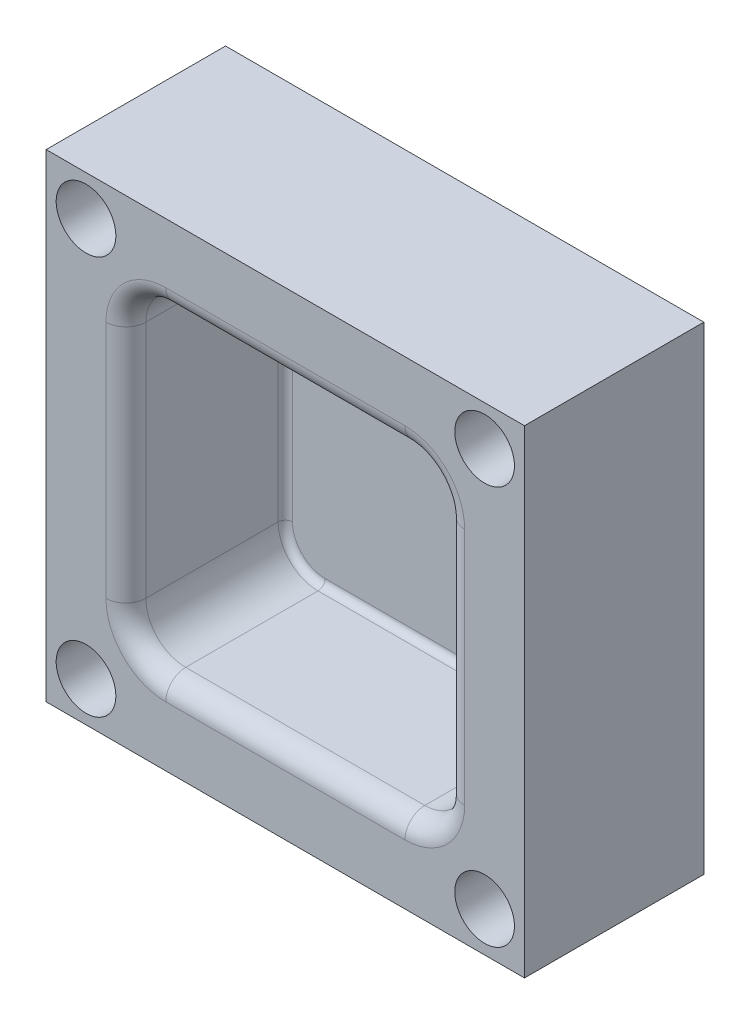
ISO-10303-21;
HEADER;
FILE_DESCRIPTION(('STEP AP214'),'2;1');
FILE_NAME('part.step','',(''),(''),'','','');
FILE_SCHEMA(('AUTOMOTIVE_DESIGN { 1 0 10303 214 1 1 1 1 }'));
ENDSEC;
DATA;
#1=APPLICATION_CONTEXT('core data for automotive mechanical design processes');
#2=APPLICATION_PROTOCOL_DEFINITION('international standard','automotive_design',2000,#1);
#3=PRODUCT_CONTEXT('',#1,'mechanical');
#4=PRODUCT('Part','Part','',(#3));
#5=PRODUCT_RELATED_PRODUCT_CATEGORY('part','',(#4));
#6=PRODUCT_DEFINITION_FORMATION('','',#4);
#7=PRODUCT_DEFINITION_CONTEXT('part definition',#1,'design');
#8=PRODUCT_DEFINITION('design','',#6,#7);
#9=PRODUCT_DEFINITION_SHAPE('','',#8);
#10=(LENGTH_UNIT() NAMED_UNIT(*) SI_UNIT(.MILLI.,.METRE.));
#11=(NAMED_UNIT(*) PLANE_ANGLE_UNIT() SI_UNIT($,.RADIAN.));
#12=(NAMED_UNIT(*) SI_UNIT($,.STERADIAN.) SOLID_ANGLE_UNIT());
#13=UNCERTAINTY_MEASURE_WITH_UNIT(LENGTH_MEASURE(1.E-05),#10,'distance_accuracy_value','');
#14=(GEOMETRIC_REPRESENTATION_CONTEXT(3) GLOBAL_UNCERTAINTY_ASSIGNED_CONTEXT((#13)) GLOBAL_UNIT_ASSIGNED_CONTEXT((#10,
#11,#12)) REPRESENTATION_CONTEXT('',''));
#15=CARTESIAN_POINT('',(0.,0.,0.));
#16=DIRECTION('',(0.,0.,1.));
#17=DIRECTION('',(1.,0.,0.));
#18=AXIS2_PLACEMENT_3D('',#15,#16,#17);
#19=CARTESIAN_POINT('',(31.75,-31.75,0.));
#20=DIRECTION('',(0.,0.,1.));
#21=DIRECTION('',(1.,0.,0.));
#22=AXIS2_PLACEMENT_3D('',#19,#20,#21);
#23=CYLINDRICAL_SURFACE('',#22,2.37791997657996);
#24=CARTESIAN_POINT('',(31.75,-31.75,0.));
#25=DIRECTION('',(0.,0.,1.));
#26=DIRECTION('',(1.,0.,0.));
#27=AXIS2_PLACEMENT_3D('',#24,#25,#26);
#28=CIRCLE('',#27,2.37791997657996);
#29=CARTESIAN_POINT('',(34.1279199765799,-31.75,0.));
#30=VERTEX_POINT('',#29);
#31=EDGE_CURVE('E215',#30,#30,#28,.T.);
#32=CARTESIAN_POINT('',(31.75,-31.75,19.05));
#33=DIRECTION('',(0.,0.,1.));
#34=DIRECTION('',(1.,0.,0.));
#35=AXIS2_PLACEMENT_3D('',#32,#33,#34);
#36=CIRCLE('',#35,2.37791997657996);
#37=CARTESIAN_POINT('',(34.1279199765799,-31.75,19.05));
#38=VERTEX_POINT('',#37);
#39=EDGE_CURVE('E227',#38,#38,#36,.F.);
#40=CARTESIAN_POINT('',(34.1279199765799,-31.75,0.));
#41=CARTESIAN_POINT('',(34.1279199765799,-31.75,0.1984375));
#42=CARTESIAN_POINT('',(34.1279199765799,-31.75,0.396875));
#43=CARTESIAN_POINT('',(34.1279199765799,-31.75,0.79375));
#44=CARTESIAN_POINT('',(34.1279199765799,-31.75,0.9921875));
#45=CARTESIAN_POINT('',(34.1279199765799,-31.75,1.3890625));
#46=CARTESIAN_POINT('',(34.1279199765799,-31.75,1.5875));
#47=CARTESIAN_POINT('',(34.1279199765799,-31.75,1.984375));
#48=CARTESIAN_POINT('',(34.1279199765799,-31.75,2.1828125));
#49=CARTESIAN_POINT('',(34.1279199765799,-31.75,2.5796875));
#50=CARTESIAN_POINT('',(34.1279199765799,-31.75,2.778125));
#51=CARTESIAN_POINT('',(34.1279199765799,-31.75,3.175));
#52=CARTESIAN_POINT('',(34.1279199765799,-31.75,3.3734375));
#53=CARTESIAN_POINT('',(34.1279199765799,-31.75,3.7703125));
#54=CARTESIAN_POINT('',(34.1279199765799,-31.75,3.96875));
#55=CARTESIAN_POINT('',(34.1279199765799,-31.75,4.365625));
#56=CARTESIAN_POINT('',(34.1279199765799,-31.75,4.5640625));
#57=CARTESIAN_POINT('',(34.1279199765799,-31.75,4.9609375));
#58=CARTESIAN_POINT('',(34.1279199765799,-31.75,5.159375));
#59=CARTESIAN_POINT('',(34.1279199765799,-31.75,5.55625));
#60=CARTESIAN_POINT('',(34.1279199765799,-31.75,5.7546875));
#61=CARTESIAN_POINT('',(34.1279199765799,-31.75,6.1515625));
#62=CARTESIAN_POINT('',(34.1279199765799,-31.75,6.35));
#63=CARTESIAN_POINT('',(34.1279199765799,-31.75,6.746875));
#64=CARTESIAN_POINT('',(34.1279199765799,-31.75,6.9453125));
#65=CARTESIAN_POINT('',(34.1279199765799,-31.75,7.3421875));
#66=CARTESIAN_POINT('',(34.1279199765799,-31.75,7.540625));
#67=CARTESIAN_POINT('',(34.1279199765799,-31.75,7.9375));
#68=CARTESIAN_POINT('',(34.1279199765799,-31.75,8.1359375));
#69=CARTESIAN_POINT('',(34.1279199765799,-31.75,8.5328125));
#70=CARTESIAN_POINT('',(34.1279199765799,-31.75,8.73125));
#71=CARTESIAN_POINT('',(34.1279199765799,-31.75,9.128125));
#72=CARTESIAN_POINT('',(34.1279199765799,-31.75,9.3265625));
#73=CARTESIAN_POINT('',(34.1279199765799,-31.75,9.7234375));
#74=CARTESIAN_POINT('',(34.1279199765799,-31.75,9.921875));
#75=CARTESIAN_POINT('',(34.1279199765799,-31.75,10.31875));
#76=CARTESIAN_POINT('',(34.1279199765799,-31.75,10.5171875));
#77=CARTESIAN_POINT('',(34.1279199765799,-31.75,10.9140625));
#78=CARTESIAN_POINT('',(34.1279199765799,-31.75,11.1125));
#79=CARTESIAN_POINT('',(34.1279199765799,-31.75,11.509375));
#80=CARTESIAN_POINT('',(34.1279199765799,-31.75,11.7078125));
#81=CARTESIAN_POINT('',(34.1279199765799,-31.75,12.1046875));
#82=CARTESIAN_POINT('',(34.1279199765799,-31.75,12.303125));
#83=CARTESIAN_POINT('',(34.1279199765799,-31.75,12.7));
#84=CARTESIAN_POINT('',(34.1279199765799,-31.75,12.8984375));
#85=CARTESIAN_POINT('',(34.1279199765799,-31.75,13.2953125));
#86=CARTESIAN_POINT('',(34.1279199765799,-31.75,13.49375));
#87=CARTESIAN_POINT('',(34.1279199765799,-31.75,13.890625));
#88=CARTESIAN_POINT('',(34.1279199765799,-31.75,14.0890625));
#89=CARTESIAN_POINT('',(34.1279199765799,-31.75,14.4859375));
#90=CARTESIAN_POINT('',(34.1279199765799,-31.75,14.684375));
#91=CARTESIAN_POINT('',(34.1279199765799,-31.75,15.08125));
#92=CARTESIAN_POINT('',(34.1279199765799,-31.75,15.2796875));
#93=CARTESIAN_POINT('',(34.1279199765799,-31.75,15.6765625));
#94=CARTESIAN_POINT('',(34.1279199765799,-31.75,15.875));
#95=CARTESIAN_POINT('',(34.1279199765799,-31.75,16.271875));
#96=CARTESIAN_POINT('',(34.1279199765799,-31.75,16.4703125));
#97=CARTESIAN_POINT('',(34.1279199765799,-31.75,16.8671875));
#98=CARTESIAN_POINT('',(34.1279199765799,-31.75,17.065625));
#99=CARTESIAN_POINT('',(34.1279199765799,-31.75,17.4625));
#100=CARTESIAN_POINT('',(34.1279199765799,-31.75,17.6609375));
#101=CARTESIAN_POINT('',(34.1279199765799,-31.75,18.0578125));
#102=CARTESIAN_POINT('',(34.1279199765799,-31.75,18.25625));
#103=CARTESIAN_POINT('',(34.1279199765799,-31.75,18.653125));
#104=CARTESIAN_POINT('',(34.1279199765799,-31.75,18.8515625));
#105=CARTESIAN_POINT('',(34.1279199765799,-31.75,19.05));
#106=B_SPLINE_CURVE_WITH_KNOTS('',3,(#40,#41,#42,#43,#44,#45,#46,#47,#48,#49,#50,#51,#52,#53,
#54,#55,#56,#57,#58,#59,#60,#61,#62,#63,#64,#65,#66,#67,#68,#69,#70,#71,#72,#73,#74,#75,#76,#77,
#78,#79,#80,#81,#82,#83,#84,#85,#86,#87,#88,#89,#90,#91,#92,#93,#94,#95,#96,#97,#98,#99,#100,
#101,#102,#103,#104,#105),.UNSPECIFIED.,.F.,.F.,(4,2,2,2,2,2,2,2,2,2,2,2,2,2,2,2,2,2,2,2,2,2,2,
2,2,2,2,2,2,2,2,2,4),(0.,0.5953125,1.190625,1.7859375,2.38125,2.9765625,3.571875,4.1671875,
4.7625,5.3578125,5.953125,6.5484375,7.14375,7.7390625,8.334375,8.9296875,9.525,10.1203125,
10.715625,11.3109375,11.90625,12.5015625,13.096875,13.6921875,14.2875,14.8828125,15.478125,
16.0734375,16.66875,17.2640625,17.859375,18.4546875,19.05),.UNSPECIFIED.);
#107=EDGE_CURVE('BSEAM31',#30,#38,#106,.T.);
#108=ORIENTED_EDGE('',*,*,#31,.F.);
#109=ORIENTED_EDGE('',*,*,#39,.F.);
#110=ORIENTED_EDGE('',*,*,#107,.T.);
#111=ORIENTED_EDGE('',*,*,#107,.F.);
#112=EDGE_LOOP('',(#108,#110,#109,#111));
#113=FACE_BOUND('',#112,.T.);
#114=ADVANCED_FACE('F31',(#113),#23,.F.);
#115=CARTESIAN_POINT('',(-31.75,-31.75,0.));
#116=DIRECTION('',(0.,0.,1.));
#117=DIRECTION('',(1.,0.,0.));
#118=AXIS2_PLACEMENT_3D('',#115,#116,#117);
#119=CYLINDRICAL_SURFACE('',#118,2.37791997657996);
#120=CARTESIAN_POINT('',(-31.75,-31.75,0.));
#121=DIRECTION('',(0.,0.,1.));
#122=DIRECTION('',(1.,0.,0.));
#123=AXIS2_PLACEMENT_3D('',#120,#121,#122);
#124=CIRCLE('',#123,2.37791997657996);
#125=CARTESIAN_POINT('',(-29.37208002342,-31.75,0.));
#126=VERTEX_POINT('',#125);
#127=EDGE_CURVE('E356',#126,#126,#124,.T.);
#128=CARTESIAN_POINT('',(-31.75,-31.75,19.05));
#129=DIRECTION('',(0.,0.,1.));
#130=DIRECTION('',(1.,0.,0.));
#131=AXIS2_PLACEMENT_3D('',#128,#129,#130);
#132=CIRCLE('',#131,2.37791997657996);
#133=CARTESIAN_POINT('',(-29.37208002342,-31.75,19.05));
#134=VERTEX_POINT('',#133);
#135=EDGE_CURVE('E222',#134,#134,#132,.F.);
#136=CARTESIAN_POINT('',(-29.37208002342,-31.75,0.));
#137=CARTESIAN_POINT('',(-29.37208002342,-31.75,0.1984375));
#138=CARTESIAN_POINT('',(-29.37208002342,-31.75,0.396875));
#139=CARTESIAN_POINT('',(-29.37208002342,-31.75,0.79375));
#140=CARTESIAN_POINT('',(-29.37208002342,-31.75,0.9921875));
#141=CARTESIAN_POINT('',(-29.37208002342,-31.75,1.3890625));
#142=CARTESIAN_POINT('',(-29.37208002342,-31.75,1.5875));
#143=CARTESIAN_POINT('',(-29.37208002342,-31.75,1.984375));
#144=CARTESIAN_POINT('',(-29.37208002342,-31.75,2.1828125));
#145=CARTESIAN_POINT('',(-29.37208002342,-31.75,2.5796875));
#146=CARTESIAN_POINT('',(-29.37208002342,-31.75,2.778125));
#147=CARTESIAN_POINT('',(-29.37208002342,-31.75,3.175));
#148=CARTESIAN_POINT('',(-29.37208002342,-31.75,3.3734375));
#149=CARTESIAN_POINT('',(-29.37208002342,-31.75,3.7703125));
#150=CARTESIAN_POINT('',(-29.37208002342,-31.75,3.96875));
#151=CARTESIAN_POINT('',(-29.37208002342,-31.75,4.365625));
#152=CARTESIAN_POINT('',(-29.37208002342,-31.75,4.5640625));
#153=CARTESIAN_POINT('',(-29.37208002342,-31.75,4.9609375));
#154=CARTESIAN_POINT('',(-29.37208002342,-31.75,5.159375));
#155=CARTESIAN_POINT('',(-29.37208002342,-31.75,5.55625));
#156=CARTESIAN_POINT('',(-29.37208002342,-31.75,5.7546875));
#157=CARTESIAN_POINT('',(-29.37208002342,-31.75,6.1515625));
#158=CARTESIAN_POINT('',(-29.37208002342,-31.75,6.35));
#159=CARTESIAN_POINT('',(-29.37208002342,-31.75,6.746875));
#160=CARTESIAN_POINT('',(-29.37208002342,-31.75,6.9453125));
#161=CARTESIAN_POINT('',(-29.37208002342,-31.75,7.3421875));
#162=CARTESIAN_POINT('',(-29.37208002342,-31.75,7.540625));
#163=CARTESIAN_POINT('',(-29.37208002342,-31.75,7.9375));
#164=CARTESIAN_POINT('',(-29.37208002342,-31.75,8.1359375));
#165=CARTESIAN_POINT('',(-29.37208002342,-31.75,8.5328125));
#166=CARTESIAN_POINT('',(-29.37208002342,-31.75,8.73125));
#167=CARTESIAN_POINT('',(-29.37208002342,-31.75,9.128125));
#168=CARTESIAN_POINT('',(-29.37208002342,-31.75,9.3265625));
#169=CARTESIAN_POINT('',(-29.37208002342,-31.75,9.7234375));
#170=CARTESIAN_POINT('',(-29.37208002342,-31.75,9.921875));
#171=CARTESIAN_POINT('',(-29.37208002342,-31.75,10.31875));
#172=CARTESIAN_POINT('',(-29.37208002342,-31.75,10.5171875));
#173=CARTESIAN_POINT('',(-29.37208002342,-31.75,10.9140625));
#174=CARTESIAN_POINT('',(-29.37208002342,-31.75,11.1125));
#175=CARTESIAN_POINT('',(-29.37208002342,-31.75,11.509375));
#176=CARTESIAN_POINT('',(-29.37208002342,-31.75,11.7078125));
#177=CARTESIAN_POINT('',(-29.37208002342,-31.75,12.1046875));
#178=CARTESIAN_POINT('',(-29.37208002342,-31.75,12.303125));
#179=CARTESIAN_POINT('',(-29.37208002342,-31.75,12.7));
#180=CARTESIAN_POINT('',(-29.37208002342,-31.75,12.8984375));
#181=CARTESIAN_POINT('',(-29.37208002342,-31.75,13.2953125));
#182=CARTESIAN_POINT('',(-29.37208002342,-31.75,13.49375));
#183=CARTESIAN_POINT('',(-29.37208002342,-31.75,13.890625));
#184=CARTESIAN_POINT('',(-29.37208002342,-31.75,14.0890625));
#185=CARTESIAN_POINT('',(-29.37208002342,-31.75,14.4859375));
#186=CARTESIAN_POINT('',(-29.37208002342,-31.75,14.684375));
#187=CARTESIAN_POINT('',(-29.37208002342,-31.75,15.08125));
#188=CARTESIAN_POINT('',(-29.37208002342,-31.75,15.2796875));
#189=CARTESIAN_POINT('',(-29.37208002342,-31.75,15.6765625));
#190=CARTESIAN_POINT('',(-29.37208002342,-31.75,15.875));
#191=CARTESIAN_POINT('',(-29.37208002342,-31.75,16.271875));
#192=CARTESIAN_POINT('',(-29.37208002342,-31.75,16.4703125));
#193=CARTESIAN_POINT('',(-29.37208002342,-31.75,16.8671875));
#194=CARTESIAN_POINT('',(-29.37208002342,-31.75,17.065625));
#195=CARTESIAN_POINT('',(-29.37208002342,-31.75,17.4625));
#196=CARTESIAN_POINT('',(-29.37208002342,-31.75,17.6609375));
#197=CARTESIAN_POINT('',(-29.37208002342,-31.75,18.0578125));
#198=CARTESIAN_POINT('',(-29.37208002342,-31.75,18.25625));
#199=CARTESIAN_POINT('',(-29.37208002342,-31.75,18.653125));
#200=CARTESIAN_POINT('',(-29.37208002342,-31.75,18.8515625));
#201=CARTESIAN_POINT('',(-29.37208002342,-31.75,19.05));
#202=B_SPLINE_CURVE_WITH_KNOTS('',3,(#136,#137,#138,#139,#140,#141,#142,#143,#144,#145,#146,
#147,#148,#149,#150,#151,#152,#153,#154,#155,#156,#157,#158,#159,#160,#161,#162,#163,#164,#165,
#166,#167,#168,#169,#170,#171,#172,#173,#174,#175,#176,#177,#178,#179,#180,#181,#182,#183,#184,
#185,#186,#187,#188,#189,#190,#191,#192,#193,#194,#195,#196,#197,#198,#199,#200,#201),
.UNSPECIFIED.,.F.,.F.,(4,2,2,2,2,2,2,2,2,2,2,2,2,2,2,2,2,2,2,2,2,2,2,2,2,2,2,2,2,2,2,2,4),(0.,
0.5953125,1.190625,1.7859375,2.38125,2.9765625,3.571875,4.1671875,4.7625,5.3578125,5.953125,
6.5484375,7.14375,7.7390625,8.334375,8.9296875,9.525,10.1203125,10.715625,11.3109375,11.90625,
12.5015625,13.096875,13.6921875,14.2875,14.8828125,15.478125,16.0734375,16.66875,17.2640625,
17.859375,18.4546875,19.05),.UNSPECIFIED.);
#203=EDGE_CURVE('BSEAM444',#126,#134,#202,.T.);
#204=ORIENTED_EDGE('',*,*,#127,.F.);
#205=ORIENTED_EDGE('',*,*,#135,.F.);
#206=ORIENTED_EDGE('',*,*,#203,.T.);
#207=ORIENTED_EDGE('',*,*,#203,.F.);
#208=EDGE_LOOP('',(#204,#206,#205,#207));
#209=FACE_BOUND('',#208,.T.);
#210=ADVANCED_FACE('F444',(#209),#119,.F.);
#211=CARTESIAN_POINT('',(31.75,31.75,0.));
#212=DIRECTION('',(0.,0.,1.));
#213=DIRECTION('',(1.,0.,0.));
#214=AXIS2_PLACEMENT_3D('',#211,#212,#213);
#215=CYLINDRICAL_SURFACE('',#214,2.37791997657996);
#216=CARTESIAN_POINT('',(31.75,31.75,0.));
#217=DIRECTION('',(0.,0.,1.));
#218=DIRECTION('',(1.,0.,0.));
#219=AXIS2_PLACEMENT_3D('',#216,#217,#218);
#220=CIRCLE('',#219,2.37791997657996);
#221=CARTESIAN_POINT('',(34.12791997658,31.75,0.));
#222=VERTEX_POINT('',#221);
#223=EDGE_CURVE('E361',#222,#222,#220,.T.);
#224=CARTESIAN_POINT('',(31.75,31.75,19.05));
#225=DIRECTION('',(0.,0.,1.));
#226=DIRECTION('',(1.,0.,0.));
#227=AXIS2_PLACEMENT_3D('',#224,#225,#226);
#228=CIRCLE('',#227,2.37791997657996);
#229=CARTESIAN_POINT('',(34.12791997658,31.75,19.05));
#230=VERTEX_POINT('',#229);
#231=EDGE_CURVE('E217',#230,#230,#228,.F.);
#232=CARTESIAN_POINT('',(34.12791997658,31.75,0.));
#233=CARTESIAN_POINT('',(34.12791997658,31.75,0.1984375));
#234=CARTESIAN_POINT('',(34.12791997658,31.75,0.396875));
#235=CARTESIAN_POINT('',(34.12791997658,31.75,0.79375));
#236=CARTESIAN_POINT('',(34.12791997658,31.75,0.9921875));
#237=CARTESIAN_POINT('',(34.12791997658,31.75,1.3890625));
#238=CARTESIAN_POINT('',(34.12791997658,31.75,1.5875));
#239=CARTESIAN_POINT('',(34.12791997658,31.75,1.984375));
#240=CARTESIAN_POINT('',(34.12791997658,31.75,2.1828125));
#241=CARTESIAN_POINT('',(34.12791997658,31.75,2.5796875));
#242=CARTESIAN_POINT('',(34.12791997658,31.75,2.778125));
#243=CARTESIAN_POINT('',(34.12791997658,31.75,3.175));
#244=CARTESIAN_POINT('',(34.12791997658,31.75,3.3734375));
#245=CARTESIAN_POINT('',(34.12791997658,31.75,3.7703125));
#246=CARTESIAN_POINT('',(34.12791997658,31.75,3.96875));
#247=CARTESIAN_POINT('',(34.12791997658,31.75,4.365625));
#248=CARTESIAN_POINT('',(34.12791997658,31.75,4.5640625));
#249=CARTESIAN_POINT('',(34.12791997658,31.75,4.9609375));
#250=CARTESIAN_POINT('',(34.12791997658,31.75,5.159375));
#251=CARTESIAN_POINT('',(34.12791997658,31.75,5.55625));
#252=CARTESIAN_POINT('',(34.12791997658,31.75,5.7546875));
#253=CARTESIAN_POINT('',(34.12791997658,31.75,6.1515625));
#254=CARTESIAN_POINT('',(34.12791997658,31.75,6.35));
#255=CARTESIAN_POINT('',(34.12791997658,31.75,6.746875));
#256=CARTESIAN_POINT('',(34.12791997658,31.75,6.9453125));
#257=CARTESIAN_POINT('',(34.12791997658,31.75,7.3421875));
#258=CARTESIAN_POINT('',(34.12791997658,31.75,7.540625));
#259=CARTESIAN_POINT('',(34.12791997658,31.75,7.9375));
#260=CARTESIAN_POINT('',(34.12791997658,31.75,8.1359375));
#261=CARTESIAN_POINT('',(34.12791997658,31.75,8.5328125));
#262=CARTESIAN_POINT('',(34.12791997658,31.75,8.73125));
#263=CARTESIAN_POINT('',(34.12791997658,31.75,9.128125));
#264=CARTESIAN_POINT('',(34.12791997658,31.75,9.3265625));
#265=CARTESIAN_POINT('',(34.12791997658,31.75,9.7234375));
#266=CARTESIAN_POINT('',(34.12791997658,31.75,9.921875));
#267=CARTESIAN_POINT('',(34.12791997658,31.75,10.31875));
#268=CARTESIAN_POINT('',(34.12791997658,31.75,10.5171875));
#269=CARTESIAN_POINT('',(34.12791997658,31.75,10.9140625));
#270=CARTESIAN_POINT('',(34.12791997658,31.75,11.1125));
#271=CARTESIAN_POINT('',(34.12791997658,31.75,11.509375));
#272=CARTESIAN_POINT('',(34.12791997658,31.75,11.7078125));
#273=CARTESIAN_POINT('',(34.12791997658,31.75,12.1046875));
#274=CARTESIAN_POINT('',(34.12791997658,31.75,12.303125));
#275=CARTESIAN_POINT('',(34.12791997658,31.75,12.7));
#276=CARTESIAN_POINT('',(34.12791997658,31.75,12.8984375));
#277=CARTESIAN_POINT('',(34.12791997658,31.75,13.2953125));
#278=CARTESIAN_POINT('',(34.12791997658,31.75,13.49375));
#279=CARTESIAN_POINT('',(34.12791997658,31.75,13.890625));
#280=CARTESIAN_POINT('',(34.12791997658,31.75,14.0890625));
#281=CARTESIAN_POINT('',(34.12791997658,31.75,14.4859375));
#282=CARTESIAN_POINT('',(34.12791997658,31.75,14.684375));
#283=CARTESIAN_POINT('',(34.12791997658,31.75,15.08125));
#284=CARTESIAN_POINT('',(34.12791997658,31.75,15.2796875));
#285=CARTESIAN_POINT('',(34.12791997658,31.75,15.6765625));
#286=CARTESIAN_POINT('',(34.12791997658,31.75,15.875));
#287=CARTESIAN_POINT('',(34.12791997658,31.75,16.271875));
#288=CARTESIAN_POINT('',(34.12791997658,31.75,16.4703125));
#289=CARTESIAN_POINT('',(34.12791997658,31.75,16.8671875));
#290=CARTESIAN_POINT('',(34.12791997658,31.75,17.065625));
#291=CARTESIAN_POINT('',(34.12791997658,31.75,17.4625));
#292=CARTESIAN_POINT('',(34.12791997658,31.75,17.6609375));
#293=CARTESIAN_POINT('',(34.12791997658,31.75,18.0578125));
#294=CARTESIAN_POINT('',(34.12791997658,31.75,18.25625));
#295=CARTESIAN_POINT('',(34.12791997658,31.75,18.653125));
#296=CARTESIAN_POINT('',(34.12791997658,31.75,18.8515625));
#297=CARTESIAN_POINT('',(34.12791997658,31.75,19.05));
#298=B_SPLINE_CURVE_WITH_KNOTS('',3,(#232,#233,#234,#235,#236,#237,#238,#239,#240,#241,#242,
#243,#244,#245,#246,#247,#248,#249,#250,#251,#252,#253,#254,#255,#256,#257,#258,#259,#260,#261,
#262,#263,#264,#265,#266,#267,#268,#269,#270,#271,#272,#273,#274,#275,#276,#277,#278,#279,#280,
#281,#282,#283,#284,#285,#286,#287,#288,#289,#290,#291,#292,#293,#294,#295,#296,#297),
.UNSPECIFIED.,.F.,.F.,(4,2,2,2,2,2,2,2,2,2,2,2,2,2,2,2,2,2,2,2,2,2,2,2,2,2,2,2,2,2,2,2,4),(0.,
0.5953125,1.190625,1.7859375,2.38125,2.9765625,3.571875,4.1671875,4.7625,5.3578125,5.953125,
6.5484375,7.14375,7.7390625,8.334375,8.9296875,9.525,10.1203125,10.715625,11.3109375,11.90625,
12.5015625,13.096875,13.6921875,14.2875,14.8828125,15.478125,16.0734375,16.66875,17.2640625,
17.859375,18.4546875,19.05),.UNSPECIFIED.);
#299=EDGE_CURVE('BSEAM440',#222,#230,#298,.T.);
#300=ORIENTED_EDGE('',*,*,#223,.F.);
#301=ORIENTED_EDGE('',*,*,#231,.F.);
#302=ORIENTED_EDGE('',*,*,#299,.T.);
#303=ORIENTED_EDGE('',*,*,#299,.F.);
#304=EDGE_LOOP('',(#300,#302,#301,#303));
#305=FACE_BOUND('',#304,.T.);
#306=ADVANCED_FACE('F440',(#305),#215,.F.);
#307=CARTESIAN_POINT('',(-31.75,31.75,0.));
#308=DIRECTION('',(0.,0.,1.));
#309=DIRECTION('',(1.,0.,0.));
#310=AXIS2_PLACEMENT_3D('',#307,#308,#309);
#311=CYLINDRICAL_SURFACE('',#310,2.37791997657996);
#312=CARTESIAN_POINT('',(-31.75,31.75,0.));
#313=DIRECTION('',(0.,0.,1.));
#314=DIRECTION('',(1.,0.,0.));
#315=AXIS2_PLACEMENT_3D('',#312,#313,#314);
#316=CIRCLE('',#315,2.37791997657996);
#317=CARTESIAN_POINT('',(-29.37208002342,31.75,0.));
#318=VERTEX_POINT('',#317);
#319=EDGE_CURVE('E354',#318,#318,#316,.T.);
#320=CARTESIAN_POINT('',(-31.75,31.75,19.05));
#321=DIRECTION('',(0.,0.,1.));
#322=DIRECTION('',(1.,0.,0.));
#323=AXIS2_PLACEMENT_3D('',#320,#321,#322);
#324=CIRCLE('',#323,2.37791997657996);
#325=CARTESIAN_POINT('',(-29.37208002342,31.75,19.05));
#326=VERTEX_POINT('',#325);
#327=EDGE_CURVE('E212',#326,#326,#324,.F.);
#328=CARTESIAN_POINT('',(-29.37208002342,31.75,0.));
#329=CARTESIAN_POINT('',(-29.37208002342,31.75,0.1984375));
#330=CARTESIAN_POINT('',(-29.37208002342,31.75,0.396875));
#331=CARTESIAN_POINT('',(-29.37208002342,31.75,0.79375));
#332=CARTESIAN_POINT('',(-29.37208002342,31.75,0.9921875));
#333=CARTESIAN_POINT('',(-29.37208002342,31.75,1.3890625));
#334=CARTESIAN_POINT('',(-29.37208002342,31.75,1.5875));
#335=CARTESIAN_POINT('',(-29.37208002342,31.75,1.984375));
#336=CARTESIAN_POINT('',(-29.37208002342,31.75,2.1828125));
#337=CARTESIAN_POINT('',(-29.37208002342,31.75,2.5796875));
#338=CARTESIAN_POINT('',(-29.37208002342,31.75,2.778125));
#339=CARTESIAN_POINT('',(-29.37208002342,31.75,3.175));
#340=CARTESIAN_POINT('',(-29.37208002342,31.75,3.3734375));
#341=CARTESIAN_POINT('',(-29.37208002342,31.75,3.7703125));
#342=CARTESIAN_POINT('',(-29.37208002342,31.75,3.96875));
#343=CARTESIAN_POINT('',(-29.37208002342,31.75,4.365625));
#344=CARTESIAN_POINT('',(-29.37208002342,31.75,4.5640625));
#345=CARTESIAN_POINT('',(-29.37208002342,31.75,4.9609375));
#346=CARTESIAN_POINT('',(-29.37208002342,31.75,5.159375));
#347=CARTESIAN_POINT('',(-29.37208002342,31.75,5.55625));
#348=CARTESIAN_POINT('',(-29.37208002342,31.75,5.7546875));
#349=CARTESIAN_POINT('',(-29.37208002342,31.75,6.1515625));
#350=CARTESIAN_POINT('',(-29.37208002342,31.75,6.35));
#351=CARTESIAN_POINT('',(-29.37208002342,31.75,6.746875));
#352=CARTESIAN_POINT('',(-29.37208002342,31.75,6.9453125));
#353=CARTESIAN_POINT('',(-29.37208002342,31.75,7.3421875));
#354=CARTESIAN_POINT('',(-29.37208002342,31.75,7.540625));
#355=CARTESIAN_POINT('',(-29.37208002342,31.75,7.9375));
#356=CARTESIAN_POINT('',(-29.37208002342,31.75,8.1359375));
#357=CARTESIAN_POINT('',(-29.37208002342,31.75,8.5328125));
#358=CARTESIAN_POINT('',(-29.37208002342,31.75,8.73125));
#359=CARTESIAN_POINT('',(-29.37208002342,31.75,9.128125));
#360=CARTESIAN_POINT('',(-29.37208002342,31.75,9.3265625));
#361=CARTESIAN_POINT('',(-29.37208002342,31.75,9.7234375));
#362=CARTESIAN_POINT('',(-29.37208002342,31.75,9.921875));
#363=CARTESIAN_POINT('',(-29.37208002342,31.75,10.31875));
#364=CARTESIAN_POINT('',(-29.37208002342,31.75,10.5171875));
#365=CARTESIAN_POINT('',(-29.37208002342,31.75,10.9140625));
#366=CARTESIAN_POINT('',(-29.37208002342,31.75,11.1125));
#367=CARTESIAN_POINT('',(-29.37208002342,31.75,11.509375));
#368=CARTESIAN_POINT('',(-29.37208002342,31.75,11.7078125));
#369=CARTESIAN_POINT('',(-29.37208002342,31.75,12.1046875));
#370=CARTESIAN_POINT('',(-29.37208002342,31.75,12.303125));
#371=CARTESIAN_POINT('',(-29.37208002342,31.75,12.7));
#372=CARTESIAN_POINT('',(-29.37208002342,31.75,12.8984375));
#373=CARTESIAN_POINT('',(-29.37208002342,31.75,13.2953125));
#374=CARTESIAN_POINT('',(-29.37208002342,31.75,13.49375));
#375=CARTESIAN_POINT('',(-29.37208002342,31.75,13.890625));
#376=CARTESIAN_POINT('',(-29.37208002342,31.75,14.0890625));
#377=CARTESIAN_POINT('',(-29.37208002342,31.75,14.4859375));
#378=CARTESIAN_POINT('',(-29.37208002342,31.75,14.684375));
#379=CARTESIAN_POINT('',(-29.37208002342,31.75,15.08125));
#380=CARTESIAN_POINT('',(-29.37208002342,31.75,15.2796875));
#381=CARTESIAN_POINT('',(-29.37208002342,31.75,15.6765625));
#382=CARTESIAN_POINT('',(-29.37208002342,31.75,15.875));
#383=CARTESIAN_POINT('',(-29.37208002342,31.75,16.271875));
#384=CARTESIAN_POINT('',(-29.37208002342,31.75,16.4703125));
#385=CARTESIAN_POINT('',(-29.37208002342,31.75,16.8671875));
#386=CARTESIAN_POINT('',(-29.37208002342,31.75,17.065625));
#387=CARTESIAN_POINT('',(-29.37208002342,31.75,17.4625));
#388=CARTESIAN_POINT('',(-29.37208002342,31.75,17.6609375));
#389=CARTESIAN_POINT('',(-29.37208002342,31.75,18.0578125));
#390=CARTESIAN_POINT('',(-29.37208002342,31.75,18.25625));
#391=CARTESIAN_POINT('',(-29.37208002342,31.75,18.653125));
#392=CARTESIAN_POINT('',(-29.37208002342,31.75,18.8515625));
#393=CARTESIAN_POINT('',(-29.37208002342,31.75,19.05));
#394=B_SPLINE_CURVE_WITH_KNOTS('',3,(#328,#329,#330,#331,#332,#333,#334,#335,#336,#337,#338,
#339,#340,#341,#342,#343,#344,#345,#346,#347,#348,#349,#350,#351,#352,#353,#354,#355,#356,#357,
#358,#359,#360,#361,#362,#363,#364,#365,#366,#367,#368,#369,#370,#371,#372,#373,#374,#375,#376,
#377,#378,#379,#380,#381,#382,#383,#384,#385,#386,#387,#388,#389,#390,#391,#392,#393),
.UNSPECIFIED.,.F.,.F.,(4,2,2,2,2,2,2,2,2,2,2,2,2,2,2,2,2,2,2,2,2,2,2,2,2,2,2,2,2,2,2,2,4),(0.,
0.5953125,1.190625,1.7859375,2.38125,2.9765625,3.571875,4.1671875,4.7625,5.3578125,5.953125,
6.5484375,7.14375,7.7390625,8.334375,8.9296875,9.525,10.1203125,10.715625,11.3109375,11.90625,
12.5015625,13.096875,13.6921875,14.2875,14.8828125,15.478125,16.0734375,16.66875,17.2640625,
17.859375,18.4546875,19.05),.UNSPECIFIED.);
#395=EDGE_CURVE('BSEAM443',#318,#326,#394,.T.);
#396=ORIENTED_EDGE('',*,*,#319,.F.);
#397=ORIENTED_EDGE('',*,*,#327,.F.);
#398=ORIENTED_EDGE('',*,*,#395,.T.);
#399=ORIENTED_EDGE('',*,*,#395,.F.);
#400=EDGE_LOOP('',(#396,#398,#397,#399));
#401=FACE_BOUND('',#400,.T.);
#402=ADVANCED_FACE('F443',(#401),#311,.F.);
#403=CARTESIAN_POINT('',(-38.1,38.1,28.575));
#404=DIRECTION('',(1.,0.,0.));
#405=DIRECTION('',(0.,1.,0.));
#406=AXIS2_PLACEMENT_3D('',#403,#404,#405);
#407=PLANE('',#406);
#408=DIRECTION('',(0.,-1.,0.));
#409=VECTOR('',#408,1.);
#410=CARTESIAN_POINT('',(-38.1,38.1,0.));
#411=LINE('',#410,#409);
#412=CARTESIAN_POINT('',(-38.1,38.1,0.));
#413=VERTEX_POINT('',#412);
#414=CARTESIAN_POINT('',(-38.1,-38.1,0.));
#415=VERTEX_POINT('',#414);
#416=EDGE_CURVE('E183',#413,#415,#411,.T.);
#417=ORIENTED_EDGE('',*,*,#416,.T.);
#418=DIRECTION('',(0.,0.,-1.));
#419=VECTOR('',#418,1.);
#420=CARTESIAN_POINT('',(-38.1,-38.1,28.575));
#421=LINE('',#420,#419);
#422=CARTESIAN_POINT('',(-38.1,-38.1,28.575));
#423=VERTEX_POINT('',#422);
#424=EDGE_CURVE('E170',#423,#415,#421,.T.);
#425=ORIENTED_EDGE('',*,*,#424,.F.);
#426=DIRECTION('',(0.,-1.,0.));
#427=VECTOR('',#426,1.);
#428=CARTESIAN_POINT('',(-38.1,38.1,28.575));
#429=LINE('',#428,#427);
#430=CARTESIAN_POINT('',(-38.1,38.1,28.575));
#431=VERTEX_POINT('',#430);
#432=EDGE_CURVE('E200',#431,#423,#429,.T.);
#433=ORIENTED_EDGE('',*,*,#432,.F.);
#434=DIRECTION('',(0.,0.,-1.));
#435=VECTOR('',#434,1.);
#436=CARTESIAN_POINT('',(-38.1,38.1,28.575));
#437=LINE('',#436,#435);
#438=EDGE_CURVE('E184',#431,#413,#437,.T.);
#439=ORIENTED_EDGE('',*,*,#438,.T.);
#440=EDGE_LOOP('',(#417,#425,#433,#439));
#441=FACE_BOUND('',#440,.T.);
#442=ADVANCED_FACE('F33',(#441),#407,.F.);
#443=CARTESIAN_POINT('',(38.1,-38.1,28.575));
#444=DIRECTION('',(0.,-1.,0.));
#445=DIRECTION('',(1.,0.,0.));
#446=AXIS2_PLACEMENT_3D('',#443,#444,#445);
#447=PLANE('',#446);
#448=DIRECTION('',(-1.,0.,0.));
#449=VECTOR('',#448,1.);
#450=CARTESIAN_POINT('',(38.1,-38.1,0.));
#451=LINE('',#450,#449);
#452=CARTESIAN_POINT('',(38.1,-38.1,0.));
#453=VERTEX_POINT('',#452);
#454=EDGE_CURVE('E174',#453,#415,#451,.T.);
#455=ORIENTED_EDGE('',*,*,#454,.F.);
#456=DIRECTION('',(0.,0.,-1.));
#457=VECTOR('',#456,1.);
#458=CARTESIAN_POINT('',(38.1,-38.1,28.575));
#459=LINE('',#458,#457);
#460=CARTESIAN_POINT('',(38.1,-38.1,28.575));
#461=VERTEX_POINT('',#460);
#462=EDGE_CURVE('E180',#461,#453,#459,.T.);
#463=ORIENTED_EDGE('',*,*,#462,.F.);
#464=DIRECTION('',(-1.,0.,0.));
#465=VECTOR('',#464,1.);
#466=CARTESIAN_POINT('',(38.1,-38.1,28.575));
#467=LINE('',#466,#465);
#468=EDGE_CURVE('E176',#461,#423,#467,.T.);
#469=ORIENTED_EDGE('',*,*,#468,.T.);
#470=ORIENTED_EDGE('',*,*,#424,.T.);
#471=EDGE_LOOP('',(#455,#463,#469,#470));
#472=FACE_BOUND('',#471,.T.);
#473=ADVANCED_FACE('F172',(#472),#447,.T.);
#474=CARTESIAN_POINT('',(38.1,-38.1,28.575));
#475=DIRECTION('',(-1.,0.,0.));
#476=DIRECTION('',(0.,-1.,0.));
#477=AXIS2_PLACEMENT_3D('',#474,#475,#476);
#478=PLANE('',#477);
#479=DIRECTION('',(0.,1.,0.));
#480=VECTOR('',#479,1.);
#481=CARTESIAN_POINT('',(38.1,-38.1,0.));
#482=LINE('',#481,#480);
#483=CARTESIAN_POINT('',(38.1,38.1,0.));
#484=VERTEX_POINT('',#483);
#485=EDGE_CURVE('E193',#453,#484,#482,.T.);
#486=ORIENTED_EDGE('',*,*,#485,.T.);
#487=DIRECTION('',(0.,0.,-1.));
#488=VECTOR('',#487,1.);
#489=CARTESIAN_POINT('',(38.1,38.1,28.575));
#490=LINE('',#489,#488);
#491=CARTESIAN_POINT('',(38.1,38.1,28.575));
#492=VERTEX_POINT('',#491);
#493=EDGE_CURVE('E209',#492,#484,#490,.T.);
#494=ORIENTED_EDGE('',*,*,#493,.F.);
#495=DIRECTION('',(0.,1.,0.));
#496=VECTOR('',#495,1.);
#497=CARTESIAN_POINT('',(38.1,-38.1,28.575));
#498=LINE('',#497,#496);
#499=EDGE_CURVE('E203',#461,#492,#498,.T.);
#500=ORIENTED_EDGE('',*,*,#499,.F.);
#501=ORIENTED_EDGE('',*,*,#462,.T.);
#502=EDGE_LOOP('',(#486,#494,#500,#501));
#503=FACE_BOUND('',#502,.T.);
#504=ADVANCED_FACE('F513',(#503),#478,.F.);
#505=CARTESIAN_POINT('',(-38.1,38.1,28.575));
#506=DIRECTION('',(0.,1.,0.));
#507=DIRECTION('',(-1.,0.,0.));
#508=AXIS2_PLACEMENT_3D('',#505,#506,#507);
#509=PLANE('',#508);
#510=DIRECTION('',(1.,0.,0.));
#511=VECTOR('',#510,1.);
#512=CARTESIAN_POINT('',(-38.1,38.1,0.));
#513=LINE('',#512,#511);
#514=EDGE_CURVE('E195',#413,#484,#513,.T.);
#515=ORIENTED_EDGE('',*,*,#514,.F.);
#516=ORIENTED_EDGE('',*,*,#438,.F.);
#517=DIRECTION('',(1.,0.,0.));
#518=VECTOR('',#517,1.);
#519=CARTESIAN_POINT('',(-38.1,38.1,28.575));
#520=LINE('',#519,#518);
#521=EDGE_CURVE('E205',#431,#492,#520,.T.);
#522=ORIENTED_EDGE('',*,*,#521,.T.);
#523=ORIENTED_EDGE('',*,*,#493,.T.);
#524=EDGE_LOOP('',(#515,#516,#522,#523));
#525=FACE_BOUND('',#524,.T.);
#526=ADVANCED_FACE('F509',(#525),#509,.T.);
#527=CARTESIAN_POINT('',(-38.1,-38.1,28.575));
#528=DIRECTION('',(0.,0.,-1.));
#529=DIRECTION('',(-1.,0.,0.));
#530=AXIS2_PLACEMENT_3D('',#527,#528,#529);
#531=PLANE('',#530);
#532=CARTESIAN_POINT('',(19.05,19.05,28.575));
#533=DIRECTION('',(0.,0.,-1.));
#534=DIRECTION('',(-1.,0.,0.));
#535=AXIS2_PLACEMENT_3D('',#532,#533,#534);
#536=CIRCLE('',#535,9.525);
#537=CARTESIAN_POINT('',(19.05,28.575,28.575));
#538=VERTEX_POINT('',#537);
#539=CARTESIAN_POINT('',(28.575,19.05,28.575));
#540=VERTEX_POINT('',#539);
#541=EDGE_CURVE('E280',#538,#540,#536,.T.);
#542=ORIENTED_EDGE('',*,*,#541,.T.);
#543=DIRECTION('',(0.,1.,0.));
#544=VECTOR('',#543,1.);
#545=CARTESIAN_POINT('',(28.575,-38.1,28.575));
#546=LINE('',#545,#544);
#547=CARTESIAN_POINT('',(28.575,-19.05,28.575));
#548=VERTEX_POINT('',#547);
#549=EDGE_CURVE('E282',#540,#548,#546,.F.);
#550=ORIENTED_EDGE('',*,*,#549,.T.);
#551=CARTESIAN_POINT('',(19.05,-19.05,28.575));
#552=DIRECTION('',(0.,0.,-1.));
#553=DIRECTION('',(-1.,0.,0.));
#554=AXIS2_PLACEMENT_3D('',#551,#552,#553);
#555=CIRCLE('',#554,9.525);
#556=CARTESIAN_POINT('',(19.05,-28.575,28.575));
#557=VERTEX_POINT('',#556);
#558=EDGE_CURVE('E278',#548,#557,#555,.T.);
#559=ORIENTED_EDGE('',*,*,#558,.T.);
#560=DIRECTION('',(1.,0.,0.));
#561=VECTOR('',#560,1.);
#562=CARTESIAN_POINT('',(-38.1,-28.575,28.575));
#563=LINE('',#562,#561);
#564=CARTESIAN_POINT('',(-19.05,-28.575,28.575));
#565=VERTEX_POINT('',#564);
#566=EDGE_CURVE('E274',#557,#565,#563,.F.);
#567=ORIENTED_EDGE('',*,*,#566,.T.);
#568=CARTESIAN_POINT('',(-19.05,-19.05,28.575));
#569=DIRECTION('',(0.,0.,-1.));
#570=DIRECTION('',(-1.,0.,0.));
#571=AXIS2_PLACEMENT_3D('',#568,#569,#570);
#572=CIRCLE('',#571,9.525);
#573=CARTESIAN_POINT('',(-28.575,-19.05,28.575));
#574=VERTEX_POINT('',#573);
#575=EDGE_CURVE('E270',#565,#574,#572,.T.);
#576=ORIENTED_EDGE('',*,*,#575,.T.);
#577=DIRECTION('',(0.,-1.,0.));
#578=VECTOR('',#577,1.);
#579=CARTESIAN_POINT('',(-28.575,-38.1,28.575));
#580=LINE('',#579,#578);
#581=CARTESIAN_POINT('',(-28.575,19.05,28.575));
#582=VERTEX_POINT('',#581);
#583=EDGE_CURVE('E268',#574,#582,#580,.F.);
#584=ORIENTED_EDGE('',*,*,#583,.T.);
#585=CARTESIAN_POINT('',(-19.05,19.05,28.575));
#586=DIRECTION('',(0.,0.,-1.));
#587=DIRECTION('',(-1.,0.,0.));
#588=AXIS2_PLACEMENT_3D('',#585,#586,#587);
#589=CIRCLE('',#588,9.525);
#590=CARTESIAN_POINT('',(-19.05,28.575,28.575));
#591=VERTEX_POINT('',#590);
#592=EDGE_CURVE('E272',#582,#591,#589,.T.);
#593=ORIENTED_EDGE('',*,*,#592,.T.);
#594=DIRECTION('',(-1.,0.,0.));
#595=VECTOR('',#594,1.);
#596=CARTESIAN_POINT('',(-38.1,28.575,28.575));
#597=LINE('',#596,#595);
#598=EDGE_CURVE('E276',#591,#538,#597,.F.);
#599=ORIENTED_EDGE('',*,*,#598,.T.);
#600=EDGE_LOOP('',(#542,#550,#559,#567,#576,#584,#593,#599));
#601=FACE_BOUND('',#600,.T.);
#602=CARTESIAN_POINT('',(31.75,-31.75,28.575));
#603=DIRECTION('',(0.,0.,1.));
#604=DIRECTION('',(1.,0.,0.));
#605=AXIS2_PLACEMENT_3D('',#602,#603,#604);
#606=CIRCLE('',#605,4.75281997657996);
#607=CARTESIAN_POINT('',(36.5028199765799,-31.75,28.575));
#608=VERTEX_POINT('',#607);
#609=EDGE_CURVE('E417',#608,#608,#606,.T.);
#610=ORIENTED_EDGE('',*,*,#609,.F.);
#611=EDGE_LOOP('',(#610));
#612=FACE_BOUND('',#611,.T.);
#613=CARTESIAN_POINT('',(-31.75,-31.75,28.575));
#614=DIRECTION('',(0.,0.,1.));
#615=DIRECTION('',(1.,0.,0.));
#616=AXIS2_PLACEMENT_3D('',#613,#614,#615);
#617=CIRCLE('',#616,4.75281997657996);
#618=CARTESIAN_POINT('',(-26.99718002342,-31.75,28.575));
#619=VERTEX_POINT('',#618);
#620=EDGE_CURVE('E230',#619,#619,#617,.T.);
#621=ORIENTED_EDGE('',*,*,#620,.F.);
#622=EDGE_LOOP('',(#621));
#623=FACE_BOUND('',#622,.T.);
#624=CARTESIAN_POINT('',(31.75,31.75,28.575));
#625=DIRECTION('',(0.,0.,1.));
#626=DIRECTION('',(1.,0.,0.));
#627=AXIS2_PLACEMENT_3D('',#624,#625,#626);
#628=CIRCLE('',#627,4.75281997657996);
#629=CARTESIAN_POINT('',(36.50281997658,31.75,28.575));
#630=VERTEX_POINT('',#629);
#631=EDGE_CURVE('E225',#630,#630,#628,.T.);
#632=ORIENTED_EDGE('',*,*,#631,.F.);
#633=EDGE_LOOP('',(#632));
#634=FACE_BOUND('',#633,.T.);
#635=CARTESIAN_POINT('',(-31.75,31.75,28.575));
#636=DIRECTION('',(0.,0.,1.));
#637=DIRECTION('',(1.,0.,0.));
#638=AXIS2_PLACEMENT_3D('',#635,#636,#637);
#639=CIRCLE('',#638,4.75281997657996);
#640=CARTESIAN_POINT('',(-26.99718002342,31.75,28.575));
#641=VERTEX_POINT('',#640);
#642=EDGE_CURVE('E220',#641,#641,#639,.T.);
#643=ORIENTED_EDGE('',*,*,#642,.F.);
#644=EDGE_LOOP('',(#643));
#645=FACE_BOUND('',#644,.T.);
#646=ORIENTED_EDGE('',*,*,#432,.T.);
#647=ORIENTED_EDGE('',*,*,#468,.F.);
#648=ORIENTED_EDGE('',*,*,#499,.T.);
#649=ORIENTED_EDGE('',*,*,#521,.F.);
#650=EDGE_LOOP('',(#646,#647,#648,#649));
#651=FACE_BOUND('',#650,.T.);
#652=ADVANCED_FACE('F505',(#601,#612,#623,#634,#645,#651),#531,.F.);
#653=CARTESIAN_POINT('',(-38.1,-38.1,0.));
#654=DIRECTION('',(0.,0.,-1.));
#655=DIRECTION('',(-1.,0.,0.));
#656=AXIS2_PLACEMENT_3D('',#653,#654,#655);
#657=PLANE('',#656);
#658=ORIENTED_EDGE('',*,*,#31,.T.);
#659=EDGE_LOOP('',(#658));
#660=FACE_BOUND('',#659,.T.);
#661=ORIENTED_EDGE('',*,*,#223,.T.);
#662=EDGE_LOOP('',(#661));
#663=FACE_BOUND('',#662,.T.);
#664=ORIENTED_EDGE('',*,*,#127,.T.);
#665=EDGE_LOOP('',(#664));
#666=FACE_BOUND('',#665,.T.);
#667=ORIENTED_EDGE('',*,*,#319,.T.);
#668=EDGE_LOOP('',(#667));
#669=FACE_BOUND('',#668,.T.);
#670=ORIENTED_EDGE('',*,*,#416,.F.);
#671=ORIENTED_EDGE('',*,*,#514,.T.);
#672=ORIENTED_EDGE('',*,*,#485,.F.);
#673=ORIENTED_EDGE('',*,*,#454,.T.);
#674=EDGE_LOOP('',(#670,#671,#672,#673));
#675=FACE_BOUND('',#674,.T.);
#676=ADVANCED_FACE('F191',(#660,#663,#666,#669,#675),#657,.T.);
#677=CARTESIAN_POINT('',(-19.05,19.05,3.175));
#678=DIRECTION('',(0.,0.,1.));
#679=DIRECTION('',(1.,0.,0.));
#680=AXIS2_PLACEMENT_3D('',#677,#678,#679);
#681=CYLINDRICAL_SURFACE('',#680,6.35);
#682=DIRECTION('',(0.,0.,1.));
#683=VECTOR('',#682,1.);
#684=CARTESIAN_POINT('',(-19.05,25.4,3.175));
#685=LINE('',#684,#683);
#686=CARTESIAN_POINT('',(-19.05,25.4,4.318));
#687=VERTEX_POINT('',#686);
#688=CARTESIAN_POINT('',(-19.05,25.4,25.4));
#689=VERTEX_POINT('',#688);
#690=EDGE_CURVE('E188',#687,#689,#685,.T.);
#691=ORIENTED_EDGE('',*,*,#690,.T.);
#692=CARTESIAN_POINT('',(-19.05,19.05,25.4));
#693=DIRECTION('',(0.,0.,-1.));
#694=DIRECTION('',(-1.,0.,0.));
#695=AXIS2_PLACEMENT_3D('',#692,#693,#694);
#696=CIRCLE('',#695,6.35);
#697=CARTESIAN_POINT('',(-25.4,19.05,25.4));
#698=VERTEX_POINT('',#697);
#699=EDGE_CURVE('E52',#689,#698,#696,.F.);
#700=ORIENTED_EDGE('',*,*,#699,.T.);
#701=DIRECTION('',(0.,0.,1.));
#702=VECTOR('',#701,1.);
#703=CARTESIAN_POINT('',(-25.4,19.05,3.175));
#704=LINE('',#703,#702);
#705=CARTESIAN_POINT('',(-25.4,19.05,4.318));
#706=VERTEX_POINT('',#705);
#707=EDGE_CURVE('E353',#706,#698,#704,.T.);
#708=ORIENTED_EDGE('',*,*,#707,.F.);
#709=CARTESIAN_POINT('',(-19.05,19.05,4.318));
#710=DIRECTION('',(0.,0.,1.));
#711=DIRECTION('',(1.,0.,0.));
#712=AXIS2_PLACEMENT_3D('',#709,#710,#711);
#713=CIRCLE('',#712,6.35);
#714=EDGE_CURVE('E263',#706,#687,#713,.F.);
#715=ORIENTED_EDGE('',*,*,#714,.T.);
#716=EDGE_LOOP('',(#691,#700,#708,#715));
#717=FACE_BOUND('',#716,.T.);
#718=ADVANCED_FACE('F488',(#717),#681,.F.);
#719=CARTESIAN_POINT('',(19.05,25.4,3.175));
#720=DIRECTION('',(0.,1.,0.));
#721=DIRECTION('',(-1.,0.,0.));
#722=AXIS2_PLACEMENT_3D('',#719,#720,#721);
#723=PLANE('',#722);
#724=DIRECTION('',(0.,0.,1.));
#725=VECTOR('',#724,1.);
#726=CARTESIAN_POINT('',(19.05,25.4,3.175));
#727=LINE('',#726,#725);
#728=CARTESIAN_POINT('',(19.05,25.4,4.318));
#729=VERTEX_POINT('',#728);
#730=CARTESIAN_POINT('',(19.05,25.4,25.4));
#731=VERTEX_POINT('',#730);
#732=EDGE_CURVE('E348',#729,#731,#727,.T.);
#733=ORIENTED_EDGE('',*,*,#732,.T.);
#734=DIRECTION('',(-1.,0.,0.));
#735=VECTOR('',#734,1.);
#736=CARTESIAN_POINT('',(19.05,25.4,25.4));
#737=LINE('',#736,#735);
#738=EDGE_CURVE('E289',#731,#689,#737,.T.);
#739=ORIENTED_EDGE('',*,*,#738,.T.);
#740=ORIENTED_EDGE('',*,*,#690,.F.);
#741=DIRECTION('',(-1.,0.,0.));
#742=VECTOR('',#741,1.);
#743=CARTESIAN_POINT('',(19.05,25.4,4.318));
#744=LINE('',#743,#742);
#745=EDGE_CURVE('E248',#687,#729,#744,.F.);
#746=ORIENTED_EDGE('',*,*,#745,.T.);
#747=EDGE_LOOP('',(#733,#739,#740,#746));
#748=FACE_BOUND('',#747,.T.);
#749=ADVANCED_FACE('F369',(#748),#723,.F.);
#750=CARTESIAN_POINT('',(19.05,19.05,3.175));
#751=DIRECTION('',(0.,0.,1.));
#752=DIRECTION('',(1.,0.,0.));
#753=AXIS2_PLACEMENT_3D('',#750,#751,#752);
#754=CYLINDRICAL_SURFACE('',#753,6.35);
#755=DIRECTION('',(0.,0.,1.));
#756=VECTOR('',#755,1.);
#757=CARTESIAN_POINT('',(25.4,19.05,3.175));
#758=LINE('',#757,#756);
#759=CARTESIAN_POINT('',(25.4,19.05,4.318));
#760=VERTEX_POINT('',#759);
#761=CARTESIAN_POINT('',(25.4,19.05,25.4));
#762=VERTEX_POINT('',#761);
#763=EDGE_CURVE('E346',#760,#762,#758,.T.);
#764=ORIENTED_EDGE('',*,*,#763,.T.);
#765=CARTESIAN_POINT('',(19.05,19.05,25.4));
#766=DIRECTION('',(0.,0.,-1.));
#767=DIRECTION('',(-1.,0.,0.));
#768=AXIS2_PLACEMENT_3D('',#765,#766,#767);
#769=CIRCLE('',#768,6.35);
#770=EDGE_CURVE('E285',#762,#731,#769,.F.);
#771=ORIENTED_EDGE('',*,*,#770,.T.);
#772=ORIENTED_EDGE('',*,*,#732,.F.);
#773=CARTESIAN_POINT('',(19.05,19.05,4.318));
#774=DIRECTION('',(0.,0.,1.));
#775=DIRECTION('',(1.,0.,0.));
#776=AXIS2_PLACEMENT_3D('',#773,#774,#775);
#777=CIRCLE('',#776,6.35);
#778=EDGE_CURVE('E251',#729,#760,#777,.F.);
#779=ORIENTED_EDGE('',*,*,#778,.T.);
#780=EDGE_LOOP('',(#764,#771,#772,#779));
#781=FACE_BOUND('',#780,.T.);
#782=ADVANCED_FACE('F487',(#781),#754,.F.);
#783=CARTESIAN_POINT('',(25.4,-19.05,3.175));
#784=DIRECTION('',(1.,0.,0.));
#785=DIRECTION('',(0.,1.,0.));
#786=AXIS2_PLACEMENT_3D('',#783,#784,#785);
#787=PLANE('',#786);
#788=DIRECTION('',(0.,0.,1.));
#789=VECTOR('',#788,1.);
#790=CARTESIAN_POINT('',(25.4,-19.05,3.175));
#791=LINE('',#790,#789);
#792=CARTESIAN_POINT('',(25.4,-19.05,4.318));
#793=VERTEX_POINT('',#792);
#794=CARTESIAN_POINT('',(25.4,-19.05,25.4));
#795=VERTEX_POINT('',#794);
#796=EDGE_CURVE('E339',#793,#795,#791,.T.);
#797=ORIENTED_EDGE('',*,*,#796,.T.);
#798=DIRECTION('',(0.,1.,0.));
#799=VECTOR('',#798,1.);
#800=CARTESIAN_POINT('',(25.4,-19.05,25.4));
#801=LINE('',#800,#799);
#802=EDGE_CURVE('E265',#795,#762,#801,.T.);
#803=ORIENTED_EDGE('',*,*,#802,.T.);
#804=ORIENTED_EDGE('',*,*,#763,.F.);
#805=DIRECTION('',(0.,1.,0.));
#806=VECTOR('',#805,1.);
#807=CARTESIAN_POINT('',(25.4,-19.05,4.318));
#808=LINE('',#807,#806);
#809=EDGE_CURVE('E253',#760,#793,#808,.F.);
#810=ORIENTED_EDGE('',*,*,#809,.T.);
#811=EDGE_LOOP('',(#797,#803,#804,#810));
#812=FACE_BOUND('',#811,.T.);
#813=ADVANCED_FACE('F342',(#812),#787,.F.);
#814=CARTESIAN_POINT('',(19.05,-19.05,3.175));
#815=DIRECTION('',(0.,0.,1.));
#816=DIRECTION('',(1.,0.,0.));
#817=AXIS2_PLACEMENT_3D('',#814,#815,#816);
#818=CYLINDRICAL_SURFACE('',#817,6.35);
#819=DIRECTION('',(0.,0.,1.));
#820=VECTOR('',#819,1.);
#821=CARTESIAN_POINT('',(19.05,-25.4,3.175));
#822=LINE('',#821,#820);
#823=CARTESIAN_POINT('',(19.05,-25.4,4.318));
#824=VERTEX_POINT('',#823);
#825=CARTESIAN_POINT('',(19.05,-25.4,25.4));
#826=VERTEX_POINT('',#825);
#827=EDGE_CURVE('E311',#824,#826,#822,.T.);
#828=ORIENTED_EDGE('',*,*,#827,.T.);
#829=CARTESIAN_POINT('',(19.05,-19.05,25.4));
#830=DIRECTION('',(0.,0.,-1.));
#831=DIRECTION('',(-1.,0.,0.));
#832=AXIS2_PLACEMENT_3D('',#829,#830,#831);
#833=CIRCLE('',#832,6.35);
#834=EDGE_CURVE('E287',#826,#795,#833,.F.);
#835=ORIENTED_EDGE('',*,*,#834,.T.);
#836=ORIENTED_EDGE('',*,*,#796,.F.);
#837=CARTESIAN_POINT('',(19.05,-19.05,4.318));
#838=DIRECTION('',(0.,0.,1.));
#839=DIRECTION('',(1.,0.,0.));
#840=AXIS2_PLACEMENT_3D('',#837,#838,#839);
#841=CIRCLE('',#840,6.35);
#842=EDGE_CURVE('E255',#793,#824,#841,.F.);
#843=ORIENTED_EDGE('',*,*,#842,.T.);
#844=EDGE_LOOP('',(#828,#835,#836,#843));
#845=FACE_BOUND('',#844,.T.);
#846=ADVANCED_FACE('F338',(#845),#818,.F.);
#847=CARTESIAN_POINT('',(-19.05,-25.4,3.175));
#848=DIRECTION('',(0.,-1.,0.));
#849=DIRECTION('',(1.,0.,0.));
#850=AXIS2_PLACEMENT_3D('',#847,#848,#849);
#851=PLANE('',#850);
#852=DIRECTION('',(0.,0.,1.));
#853=VECTOR('',#852,1.);
#854=CARTESIAN_POINT('',(-19.05,-25.4,3.175));
#855=LINE('',#854,#853);
#856=CARTESIAN_POINT('',(-19.05,-25.4,4.318));
#857=VERTEX_POINT('',#856);
#858=CARTESIAN_POINT('',(-19.05,-25.4,25.4));
#859=VERTEX_POINT('',#858);
#860=EDGE_CURVE('E298',#857,#859,#855,.T.);
#861=ORIENTED_EDGE('',*,*,#860,.T.);
#862=DIRECTION('',(1.,0.,0.));
#863=VECTOR('',#862,1.);
#864=CARTESIAN_POINT('',(-19.05,-25.4,25.4));
#865=LINE('',#864,#863);
#866=EDGE_CURVE('E291',#859,#826,#865,.T.);
#867=ORIENTED_EDGE('',*,*,#866,.T.);
#868=ORIENTED_EDGE('',*,*,#827,.F.);
#869=DIRECTION('',(1.,0.,0.));
#870=VECTOR('',#869,1.);
#871=CARTESIAN_POINT('',(-19.05,-25.4,4.318));
#872=LINE('',#871,#870);
#873=EDGE_CURVE('E257',#824,#857,#872,.F.);
#874=ORIENTED_EDGE('',*,*,#873,.T.);
#875=EDGE_LOOP('',(#861,#867,#868,#874));
#876=FACE_BOUND('',#875,.T.);
#877=ADVANCED_FACE('F306',(#876),#851,.F.);
#878=CARTESIAN_POINT('',(-19.05,-19.05,3.175));
#879=DIRECTION('',(0.,0.,1.));
#880=DIRECTION('',(1.,0.,0.));
#881=AXIS2_PLACEMENT_3D('',#878,#879,#880);
#882=CYLINDRICAL_SURFACE('',#881,6.35);
#883=DIRECTION('',(0.,0.,1.));
#884=VECTOR('',#883,1.);
#885=CARTESIAN_POINT('',(-25.4,-19.05,3.175));
#886=LINE('',#885,#884);
#887=CARTESIAN_POINT('',(-25.4,-19.05,4.318));
#888=VERTEX_POINT('',#887);
#889=CARTESIAN_POINT('',(-25.4,-19.05,25.4));
#890=VERTEX_POINT('',#889);
#891=EDGE_CURVE('E300',#888,#890,#886,.T.);
#892=ORIENTED_EDGE('',*,*,#891,.T.);
#893=CARTESIAN_POINT('',(-19.05,-19.05,25.4));
#894=DIRECTION('',(0.,0.,-1.));
#895=DIRECTION('',(-1.,0.,0.));
#896=AXIS2_PLACEMENT_3D('',#893,#894,#895);
#897=CIRCLE('',#896,6.35);
#898=EDGE_CURVE('E39',#890,#859,#897,.F.);
#899=ORIENTED_EDGE('',*,*,#898,.T.);
#900=ORIENTED_EDGE('',*,*,#860,.F.);
#901=CARTESIAN_POINT('',(-19.05,-19.05,4.318));
#902=DIRECTION('',(0.,0.,1.));
#903=DIRECTION('',(1.,0.,0.));
#904=AXIS2_PLACEMENT_3D('',#901,#902,#903);
#905=CIRCLE('',#904,6.35);
#906=EDGE_CURVE('E259',#857,#888,#905,.F.);
#907=ORIENTED_EDGE('',*,*,#906,.T.);
#908=EDGE_LOOP('',(#892,#899,#900,#907));
#909=FACE_BOUND('',#908,.T.);
#910=ADVANCED_FACE('F297',(#909),#882,.F.);
#911=CARTESIAN_POINT('',(-25.4,19.05,3.175));
#912=DIRECTION('',(-1.,0.,0.));
#913=DIRECTION('',(0.,-1.,0.));
#914=AXIS2_PLACEMENT_3D('',#911,#912,#913);
#915=PLANE('',#914);
#916=ORIENTED_EDGE('',*,*,#707,.T.);
#917=DIRECTION('',(0.,-1.,0.));
#918=VECTOR('',#917,1.);
#919=CARTESIAN_POINT('',(-25.4,19.05,25.4));
#920=LINE('',#919,#918);
#921=EDGE_CURVE('E11',#698,#890,#920,.T.);
#922=ORIENTED_EDGE('',*,*,#921,.T.);
#923=ORIENTED_EDGE('',*,*,#891,.F.);
#924=DIRECTION('',(0.,-1.,0.));
#925=VECTOR('',#924,1.);
#926=CARTESIAN_POINT('',(-25.4,19.05,4.318));
#927=LINE('',#926,#925);
#928=EDGE_CURVE('E261',#888,#706,#927,.F.);
#929=ORIENTED_EDGE('',*,*,#928,.T.);
#930=EDGE_LOOP('',(#916,#922,#923,#929));
#931=FACE_BOUND('',#930,.T.);
#932=ADVANCED_FACE('F483',(#931),#915,.F.);
#933=CARTESIAN_POINT('',(-19.05,19.05,3.175));
#934=DIRECTION('',(0.,0.,1.));
#935=DIRECTION('',(1.,0.,0.));
#936=AXIS2_PLACEMENT_3D('',#933,#934,#935);
#937=PLANE('',#936);
#938=CARTESIAN_POINT('',(19.05,19.05,3.175));
#939=DIRECTION('',(0.,0.,1.));
#940=DIRECTION('',(1.,0.,0.));
#941=AXIS2_PLACEMENT_3D('',#938,#939,#940);
#942=CIRCLE('',#941,5.207);
#943=CARTESIAN_POINT('',(24.257,19.05,3.175));
#944=VERTEX_POINT('',#943);
#945=CARTESIAN_POINT('',(19.05,24.257,3.175));
#946=VERTEX_POINT('',#945);
#947=EDGE_CURVE('E243',#944,#946,#942,.T.);
#948=ORIENTED_EDGE('',*,*,#947,.T.);
#949=DIRECTION('',(-1.,0.,0.));
#950=VECTOR('',#949,1.);
#951=CARTESIAN_POINT('',(-19.05,24.257,3.175));
#952=LINE('',#951,#950);
#953=CARTESIAN_POINT('',(-19.05,24.257,3.175));
#954=VERTEX_POINT('',#953);
#955=EDGE_CURVE('E245',#946,#954,#952,.T.);
#956=ORIENTED_EDGE('',*,*,#955,.T.);
#957=CARTESIAN_POINT('',(-19.05,19.05,3.175));
#958=DIRECTION('',(0.,0.,1.));
#959=DIRECTION('',(1.,0.,0.));
#960=AXIS2_PLACEMENT_3D('',#957,#958,#959);
#961=CIRCLE('',#960,5.207);
#962=CARTESIAN_POINT('',(-24.257,19.05,3.175));
#963=VERTEX_POINT('',#962);
#964=EDGE_CURVE('E179',#954,#963,#961,.T.);
#965=ORIENTED_EDGE('',*,*,#964,.T.);
#966=DIRECTION('',(0.,-1.,0.));
#967=VECTOR('',#966,1.);
#968=CARTESIAN_POINT('',(-24.257,19.05,3.175));
#969=LINE('',#968,#967);
#970=CARTESIAN_POINT('',(-24.257,-19.05,3.175));
#971=VERTEX_POINT('',#970);
#972=EDGE_CURVE('E233',#963,#971,#969,.T.);
#973=ORIENTED_EDGE('',*,*,#972,.T.);
#974=CARTESIAN_POINT('',(-19.05,-19.05,3.175));
#975=DIRECTION('',(0.,0.,1.));
#976=DIRECTION('',(1.,0.,0.));
#977=AXIS2_PLACEMENT_3D('',#974,#975,#976);
#978=CIRCLE('',#977,5.207);
#979=CARTESIAN_POINT('',(-19.05,-24.257,3.175));
#980=VERTEX_POINT('',#979);
#981=EDGE_CURVE('E235',#971,#980,#978,.T.);
#982=ORIENTED_EDGE('',*,*,#981,.T.);
#983=DIRECTION('',(1.,0.,0.));
#984=VECTOR('',#983,1.);
#985=CARTESIAN_POINT('',(-19.05,-24.257,3.175));
#986=LINE('',#985,#984);
#987=CARTESIAN_POINT('',(19.05,-24.257,3.175));
#988=VERTEX_POINT('',#987);
#989=EDGE_CURVE('E237',#980,#988,#986,.T.);
#990=ORIENTED_EDGE('',*,*,#989,.T.);
#991=CARTESIAN_POINT('',(19.05,-19.05,3.175));
#992=DIRECTION('',(0.,0.,1.));
#993=DIRECTION('',(1.,0.,0.));
#994=AXIS2_PLACEMENT_3D('',#991,#992,#993);
#995=CIRCLE('',#994,5.207);
#996=CARTESIAN_POINT('',(24.257,-19.05,3.175));
#997=VERTEX_POINT('',#996);
#998=EDGE_CURVE('E239',#988,#997,#995,.T.);
#999=ORIENTED_EDGE('',*,*,#998,.T.);
#1000=DIRECTION('',(0.,1.,0.));
#1001=VECTOR('',#1000,1.);
#1002=CARTESIAN_POINT('',(24.257,19.05,3.175));
#1003=LINE('',#1002,#1001);
#1004=EDGE_CURVE('E241',#997,#944,#1003,.T.);
#1005=ORIENTED_EDGE('',*,*,#1004,.T.);
#1006=EDGE_LOOP('',(#948,#956,#965,#973,#982,#990,#999,#1005));
#1007=FACE_BOUND('',#1006,.T.);
#1008=ADVANCED_FACE('F480',(#1007),#937,.T.);
#1009=CARTESIAN_POINT('',(-31.75,31.75,19.05));
#1010=DIRECTION('',(0.,0.,1.));
#1011=DIRECTION('',(1.,0.,0.));
#1012=AXIS2_PLACEMENT_3D('',#1009,#1010,#1011);
#1013=PLANE('',#1012);
#1014=CARTESIAN_POINT('',(-31.75,31.75,19.05));
#1015=DIRECTION('',(0.,0.,1.));
#1016=DIRECTION('',(1.,0.,0.));
#1017=AXIS2_PLACEMENT_3D('',#1014,#1015,#1016);
#1018=CIRCLE('',#1017,4.75281997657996);
#1019=CARTESIAN_POINT('',(-26.99718002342,31.75,19.05));
#1020=VERTEX_POINT('',#1019);
#1021=EDGE_CURVE('E216',#1020,#1020,#1018,.T.);
#1022=ORIENTED_EDGE('',*,*,#1021,.T.);
#1023=EDGE_LOOP('',(#1022));
#1024=FACE_BOUND('',#1023,.T.);
#1025=ORIENTED_EDGE('',*,*,#327,.T.);
#1026=EDGE_LOOP('',(#1025));
#1027=FACE_BOUND('',#1026,.T.);
#1028=ADVANCED_FACE('F461',(#1024,#1027),#1013,.T.);
#1029=CARTESIAN_POINT('',(-31.75,31.75,19.05));
#1030=DIRECTION('',(0.,0.,1.));
#1031=DIRECTION('',(1.,0.,0.));
#1032=AXIS2_PLACEMENT_3D('',#1029,#1030,#1031);
#1033=CYLINDRICAL_SURFACE('',#1032,4.75281997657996);
#1034=ORIENTED_EDGE('',*,*,#1021,.F.);
#1035=EDGE_LOOP('',(#1034));
#1036=FACE_BOUND('',#1035,.T.);
#1037=ORIENTED_EDGE('',*,*,#642,.T.);
#1038=EDGE_LOOP('',(#1037));
#1039=FACE_BOUND('',#1038,.T.);
#1040=ADVANCED_FACE('F451',(#1036,#1039),#1033,.F.);
#1041=CARTESIAN_POINT('',(31.75,31.75,19.05));
#1042=DIRECTION('',(0.,0.,1.));
#1043=DIRECTION('',(1.,0.,0.));
#1044=AXIS2_PLACEMENT_3D('',#1041,#1042,#1043);
#1045=PLANE('',#1044);
#1046=CARTESIAN_POINT('',(31.75,31.75,19.05));
#1047=DIRECTION('',(0.,0.,1.));
#1048=DIRECTION('',(1.,0.,0.));
#1049=AXIS2_PLACEMENT_3D('',#1046,#1047,#1048);
#1050=CIRCLE('',#1049,4.75281997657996);
#1051=CARTESIAN_POINT('',(36.50281997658,31.75,19.05));
#1052=VERTEX_POINT('',#1051);
#1053=EDGE_CURVE('E221',#1052,#1052,#1050,.T.);
#1054=ORIENTED_EDGE('',*,*,#1053,.T.);
#1055=EDGE_LOOP('',(#1054));
#1056=FACE_BOUND('',#1055,.T.);
#1057=ORIENTED_EDGE('',*,*,#231,.T.);
#1058=EDGE_LOOP('',(#1057));
#1059=FACE_BOUND('',#1058,.T.);
#1060=ADVANCED_FACE('F448',(#1056,#1059),#1045,.T.);
#1061=CARTESIAN_POINT('',(31.75,31.75,19.05));
#1062=DIRECTION('',(0.,0.,1.));
#1063=DIRECTION('',(1.,0.,0.));
#1064=AXIS2_PLACEMENT_3D('',#1061,#1062,#1063);
#1065=CYLINDRICAL_SURFACE('',#1064,4.75281997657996);
#1066=ORIENTED_EDGE('',*,*,#1053,.F.);
#1067=EDGE_LOOP('',(#1066));
#1068=FACE_BOUND('',#1067,.T.);
#1069=ORIENTED_EDGE('',*,*,#631,.T.);
#1070=EDGE_LOOP('',(#1069));
#1071=FACE_BOUND('',#1070,.T.);
#1072=ADVANCED_FACE('F450',(#1068,#1071),#1065,.F.);
#1073=CARTESIAN_POINT('',(-31.75,-31.75,19.05));
#1074=DIRECTION('',(0.,0.,1.));
#1075=DIRECTION('',(1.,0.,0.));
#1076=AXIS2_PLACEMENT_3D('',#1073,#1074,#1075);
#1077=PLANE('',#1076);
#1078=CARTESIAN_POINT('',(-31.75,-31.75,19.05));
#1079=DIRECTION('',(0.,0.,1.));
#1080=DIRECTION('',(1.,0.,0.));
#1081=AXIS2_PLACEMENT_3D('',#1078,#1079,#1080);
#1082=CIRCLE('',#1081,4.75281997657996);
#1083=CARTESIAN_POINT('',(-26.99718002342,-31.75,19.05));
#1084=VERTEX_POINT('',#1083);
#1085=EDGE_CURVE('E226',#1084,#1084,#1082,.T.);
#1086=ORIENTED_EDGE('',*,*,#1085,.T.);
#1087=EDGE_LOOP('',(#1086));
#1088=FACE_BOUND('',#1087,.T.);
#1089=ORIENTED_EDGE('',*,*,#135,.T.);
#1090=EDGE_LOOP('',(#1089));
#1091=FACE_BOUND('',#1090,.T.);
#1092=ADVANCED_FACE('F458',(#1088,#1091),#1077,.T.);
#1093=CARTESIAN_POINT('',(-31.75,-31.75,19.05));
#1094=DIRECTION('',(0.,0.,1.));
#1095=DIRECTION('',(1.,0.,0.));
#1096=AXIS2_PLACEMENT_3D('',#1093,#1094,#1095);
#1097=CYLINDRICAL_SURFACE('',#1096,4.75281997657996);
#1098=ORIENTED_EDGE('',*,*,#1085,.F.);
#1099=EDGE_LOOP('',(#1098));
#1100=FACE_BOUND('',#1099,.T.);
#1101=ORIENTED_EDGE('',*,*,#620,.T.);
#1102=EDGE_LOOP('',(#1101));
#1103=FACE_BOUND('',#1102,.T.);
#1104=ADVANCED_FACE('F564',(#1100,#1103),#1097,.F.);
#1105=CARTESIAN_POINT('',(31.75,-31.75,19.05));
#1106=DIRECTION('',(0.,0.,1.));
#1107=DIRECTION('',(1.,0.,0.));
#1108=AXIS2_PLACEMENT_3D('',#1105,#1106,#1107);
#1109=PLANE('',#1108);
#1110=CARTESIAN_POINT('',(31.75,-31.75,19.05));
#1111=DIRECTION('',(0.,0.,1.));
#1112=DIRECTION('',(1.,0.,0.));
#1113=AXIS2_PLACEMENT_3D('',#1110,#1111,#1112);
#1114=CIRCLE('',#1113,4.75281997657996);
#1115=CARTESIAN_POINT('',(36.5028199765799,-31.75,19.05));
#1116=VERTEX_POINT('',#1115);
#1117=EDGE_CURVE('E231',#1116,#1116,#1114,.T.);
#1118=ORIENTED_EDGE('',*,*,#1117,.T.);
#1119=EDGE_LOOP('',(#1118));
#1120=FACE_BOUND('',#1119,.T.);
#1121=ORIENTED_EDGE('',*,*,#39,.T.);
#1122=EDGE_LOOP('',(#1121));
#1123=FACE_BOUND('',#1122,.T.);
#1124=ADVANCED_FACE('F572',(#1120,#1123),#1109,.T.);
#1125=CARTESIAN_POINT('',(31.75,-31.75,19.05));
#1126=DIRECTION('',(0.,0.,1.));
#1127=DIRECTION('',(1.,0.,0.));
#1128=AXIS2_PLACEMENT_3D('',#1125,#1126,#1127);
#1129=CYLINDRICAL_SURFACE('',#1128,4.75281997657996);
#1130=ORIENTED_EDGE('',*,*,#1117,.F.);
#1131=EDGE_LOOP('',(#1130));
#1132=FACE_BOUND('',#1131,.T.);
#1133=ORIENTED_EDGE('',*,*,#609,.T.);
#1134=EDGE_LOOP('',(#1133));
#1135=FACE_BOUND('',#1134,.T.);
#1136=ADVANCED_FACE('F580',(#1132,#1135),#1129,.F.);
#1137=CARTESIAN_POINT('',(-19.05,-24.257,4.318));
#1138=DIRECTION('',(1.,0.,0.));
#1139=DIRECTION('',(0.,1.,0.));
#1140=AXIS2_PLACEMENT_3D('',#1137,#1138,#1139);
#1141=CYLINDRICAL_SURFACE('',#1140,1.143);
#1142=CARTESIAN_POINT('',(-19.05,-24.257,4.318));
#1143=DIRECTION('',(1.,0.,0.));
#1144=DIRECTION('',(0.,0.,-1.));
#1145=AXIS2_PLACEMENT_3D('',#1142,#1143,#1144);
#1146=CIRCLE('',#1145,1.143);
#1147=EDGE_CURVE('E411',#857,#980,#1146,.T.);
#1148=ORIENTED_EDGE('',*,*,#1147,.F.);
#1149=ORIENTED_EDGE('',*,*,#873,.F.);
#1150=CARTESIAN_POINT('',(19.05,-24.257,4.318));
#1151=DIRECTION('',(-1.,0.,0.));
#1152=DIRECTION('',(0.,0.,1.));
#1153=AXIS2_PLACEMENT_3D('',#1150,#1151,#1152);
#1154=CIRCLE('',#1153,1.143);
#1155=EDGE_CURVE('E414',#988,#824,#1154,.T.);
#1156=ORIENTED_EDGE('',*,*,#1155,.F.);
#1157=ORIENTED_EDGE('',*,*,#989,.F.);
#1158=EDGE_LOOP('',(#1148,#1149,#1156,#1157));
#1159=FACE_BOUND('',#1158,.T.);
#1160=ADVANCED_FACE('F588',(#1159),#1141,.F.);
#1161=CARTESIAN_POINT('',(19.05,-19.05,4.318));
#1162=DIRECTION('',(0.,0.,1.));
#1163=DIRECTION('',(1.,0.,0.));
#1164=AXIS2_PLACEMENT_3D('',#1161,#1162,#1163);
#1165=TOROIDAL_SURFACE('',#1164,5.207,1.143);
#1166=ORIENTED_EDGE('',*,*,#1155,.T.);
#1167=ORIENTED_EDGE('',*,*,#842,.F.);
#1168=CARTESIAN_POINT('',(24.257,-19.05,4.318));
#1169=DIRECTION('',(0.,-1.,0.));
#1170=DIRECTION('',(0.,0.,-1.));
#1171=AXIS2_PLACEMENT_3D('',#1168,#1169,#1170);
#1172=CIRCLE('',#1171,1.143);
#1173=EDGE_CURVE('E408',#997,#793,#1172,.T.);
#1174=ORIENTED_EDGE('',*,*,#1173,.F.);
#1175=ORIENTED_EDGE('',*,*,#998,.F.);
#1176=EDGE_LOOP('',(#1166,#1167,#1174,#1175));
#1177=FACE_BOUND('',#1176,.T.);
#1178=ADVANCED_FACE('F596',(#1177),#1165,.F.);
#1179=CARTESIAN_POINT('',(-19.05,-19.05,4.318));
#1180=DIRECTION('',(0.,0.,1.));
#1181=DIRECTION('',(1.,0.,0.));
#1182=AXIS2_PLACEMENT_3D('',#1179,#1180,#1181);
#1183=TOROIDAL_SURFACE('',#1182,5.207,1.143);
#1184=ORIENTED_EDGE('',*,*,#1147,.T.);
#1185=ORIENTED_EDGE('',*,*,#981,.F.);
#1186=CARTESIAN_POINT('',(-24.257,-19.05,4.318));
#1187=DIRECTION('',(0.,-1.,0.));
#1188=DIRECTION('',(0.,0.,-1.));
#1189=AXIS2_PLACEMENT_3D('',#1186,#1187,#1188);
#1190=CIRCLE('',#1189,1.143);
#1191=EDGE_CURVE('E405',#888,#971,#1190,.T.);
#1192=ORIENTED_EDGE('',*,*,#1191,.F.);
#1193=ORIENTED_EDGE('',*,*,#906,.F.);
#1194=EDGE_LOOP('',(#1184,#1185,#1192,#1193));
#1195=FACE_BOUND('',#1194,.T.);
#1196=ADVANCED_FACE('F604',(#1195),#1183,.F.);
#1197=CARTESIAN_POINT('',(24.257,19.05,4.318));
#1198=DIRECTION('',(0.,1.,0.));
#1199=DIRECTION('',(-1.,0.,0.));
#1200=AXIS2_PLACEMENT_3D('',#1197,#1198,#1199);
#1201=CYLINDRICAL_SURFACE('',#1200,1.143);
#1202=ORIENTED_EDGE('',*,*,#1173,.T.);
#1203=ORIENTED_EDGE('',*,*,#809,.F.);
#1204=CARTESIAN_POINT('',(24.257,19.05,4.318));
#1205=DIRECTION('',(0.,-1.,0.));
#1206=DIRECTION('',(0.,0.,-1.));
#1207=AXIS2_PLACEMENT_3D('',#1204,#1205,#1206);
#1208=CIRCLE('',#1207,1.143);
#1209=EDGE_CURVE('E402',#944,#760,#1208,.T.);
#1210=ORIENTED_EDGE('',*,*,#1209,.F.);
#1211=ORIENTED_EDGE('',*,*,#1004,.F.);
#1212=EDGE_LOOP('',(#1202,#1203,#1210,#1211));
#1213=FACE_BOUND('',#1212,.T.);
#1214=ADVANCED_FACE('F612',(#1213),#1201,.F.);
#1215=CARTESIAN_POINT('',(-24.257,19.05,4.318));
#1216=DIRECTION('',(0.,-1.,0.));
#1217=DIRECTION('',(1.,0.,0.));
#1218=AXIS2_PLACEMENT_3D('',#1215,#1216,#1217);
#1219=CYLINDRICAL_SURFACE('',#1218,1.143);
#1220=ORIENTED_EDGE('',*,*,#1191,.T.);
#1221=ORIENTED_EDGE('',*,*,#972,.F.);
#1222=CARTESIAN_POINT('',(-24.257,19.05,4.318));
#1223=DIRECTION('',(0.,-1.,0.));
#1224=DIRECTION('',(0.,0.,-1.));
#1225=AXIS2_PLACEMENT_3D('',#1222,#1223,#1224);
#1226=CIRCLE('',#1225,1.143);
#1227=EDGE_CURVE('E399',#706,#963,#1226,.T.);
#1228=ORIENTED_EDGE('',*,*,#1227,.F.);
#1229=ORIENTED_EDGE('',*,*,#928,.F.);
#1230=EDGE_LOOP('',(#1220,#1221,#1228,#1229));
#1231=FACE_BOUND('',#1230,.T.);
#1232=ADVANCED_FACE('F620',(#1231),#1219,.F.);
#1233=CARTESIAN_POINT('',(19.05,19.05,4.318));
#1234=DIRECTION('',(0.,0.,1.));
#1235=DIRECTION('',(1.,0.,0.));
#1236=AXIS2_PLACEMENT_3D('',#1233,#1234,#1235);
#1237=TOROIDAL_SURFACE('',#1236,5.207,1.143);
#1238=ORIENTED_EDGE('',*,*,#1209,.T.);
#1239=ORIENTED_EDGE('',*,*,#778,.F.);
#1240=CARTESIAN_POINT('',(19.05,24.257,4.318));
#1241=DIRECTION('',(1.,0.,0.));
#1242=DIRECTION('',(0.,0.,-1.));
#1243=AXIS2_PLACEMENT_3D('',#1240,#1241,#1242);
#1244=CIRCLE('',#1243,1.143);
#1245=EDGE_CURVE('E397',#946,#729,#1244,.T.);
#1246=ORIENTED_EDGE('',*,*,#1245,.F.);
#1247=ORIENTED_EDGE('',*,*,#947,.F.);
#1248=EDGE_LOOP('',(#1238,#1239,#1246,#1247));
#1249=FACE_BOUND('',#1248,.T.);
#1250=ADVANCED_FACE('F628',(#1249),#1237,.F.);
#1251=CARTESIAN_POINT('',(-19.05,19.05,4.318));
#1252=DIRECTION('',(0.,0.,1.));
#1253=DIRECTION('',(1.,0.,0.));
#1254=AXIS2_PLACEMENT_3D('',#1251,#1252,#1253);
#1255=TOROIDAL_SURFACE('',#1254,5.207,1.143);
#1256=ORIENTED_EDGE('',*,*,#1227,.T.);
#1257=ORIENTED_EDGE('',*,*,#964,.F.);
#1258=CARTESIAN_POINT('',(-19.05,24.257,4.318));
#1259=DIRECTION('',(-1.,0.,0.));
#1260=DIRECTION('',(0.,0.,1.));
#1261=AXIS2_PLACEMENT_3D('',#1258,#1259,#1260);
#1262=CIRCLE('',#1261,1.143);
#1263=EDGE_CURVE('E395',#687,#954,#1262,.T.);
#1264=ORIENTED_EDGE('',*,*,#1263,.F.);
#1265=ORIENTED_EDGE('',*,*,#714,.F.);
#1266=EDGE_LOOP('',(#1256,#1257,#1264,#1265));
#1267=FACE_BOUND('',#1266,.T.);
#1268=ADVANCED_FACE('F636',(#1267),#1255,.F.);
#1269=CARTESIAN_POINT('',(-19.05,24.257,4.318));
#1270=DIRECTION('',(-1.,0.,0.));
#1271=DIRECTION('',(0.,-1.,0.));
#1272=AXIS2_PLACEMENT_3D('',#1269,#1270,#1271);
#1273=CYLINDRICAL_SURFACE('',#1272,1.143);
#1274=ORIENTED_EDGE('',*,*,#1245,.T.);
#1275=ORIENTED_EDGE('',*,*,#745,.F.);
#1276=ORIENTED_EDGE('',*,*,#1263,.T.);
#1277=ORIENTED_EDGE('',*,*,#955,.F.);
#1278=EDGE_LOOP('',(#1274,#1275,#1276,#1277));
#1279=FACE_BOUND('',#1278,.T.);
#1280=ADVANCED_FACE('F644',(#1279),#1273,.F.);
#1281=CARTESIAN_POINT('',(-28.575,19.05,25.4));
#1282=DIRECTION('',(0.,-1.,0.));
#1283=DIRECTION('',(1.,0.,0.));
#1284=AXIS2_PLACEMENT_3D('',#1281,#1282,#1283);
#1285=CYLINDRICAL_SURFACE('',#1284,3.175);
#1286=CARTESIAN_POINT('',(-28.575,19.05,25.4));
#1287=DIRECTION('',(0.,1.,0.));
#1288=DIRECTION('',(0.,0.,1.));
#1289=AXIS2_PLACEMENT_3D('',#1286,#1287,#1288);
#1290=CIRCLE('',#1289,3.175);
#1291=EDGE_CURVE('E319',#582,#698,#1290,.T.);
#1292=ORIENTED_EDGE('',*,*,#1291,.F.);
#1293=ORIENTED_EDGE('',*,*,#583,.F.);
#1294=CARTESIAN_POINT('',(-28.575,-19.05,25.4));
#1295=DIRECTION('',(0.,-1.,0.));
#1296=DIRECTION('',(0.,0.,-1.));
#1297=AXIS2_PLACEMENT_3D('',#1294,#1295,#1296);
#1298=CIRCLE('',#1297,3.175);
#1299=EDGE_CURVE('E393',#890,#574,#1298,.T.);
#1300=ORIENTED_EDGE('',*,*,#1299,.F.);
#1301=ORIENTED_EDGE('',*,*,#921,.F.);
#1302=EDGE_LOOP('',(#1292,#1293,#1300,#1301));
#1303=FACE_BOUND('',#1302,.T.);
#1304=ADVANCED_FACE('F652',(#1303),#1285,.T.);
#1305=CARTESIAN_POINT('',(-19.05,-19.05,25.4));
#1306=DIRECTION('',(0.,0.,-1.));
#1307=DIRECTION('',(-1.,0.,0.));
#1308=AXIS2_PLACEMENT_3D('',#1305,#1306,#1307);
#1309=TOROIDAL_SURFACE('',#1308,9.525,3.175);
#1310=ORIENTED_EDGE('',*,*,#1299,.T.);
#1311=ORIENTED_EDGE('',*,*,#575,.F.);
#1312=CARTESIAN_POINT('',(-19.05,-28.575,25.4));
#1313=DIRECTION('',(1.,0.,0.));
#1314=DIRECTION('',(0.,0.,-1.));
#1315=AXIS2_PLACEMENT_3D('',#1312,#1313,#1314);
#1316=CIRCLE('',#1315,3.175);
#1317=EDGE_CURVE('E315',#859,#565,#1316,.T.);
#1318=ORIENTED_EDGE('',*,*,#1317,.F.);
#1319=ORIENTED_EDGE('',*,*,#898,.F.);
#1320=EDGE_LOOP('',(#1310,#1311,#1318,#1319));
#1321=FACE_BOUND('',#1320,.T.);
#1322=ADVANCED_FACE('F316',(#1321),#1309,.T.);
#1323=CARTESIAN_POINT('',(-19.05,19.05,25.4));
#1324=DIRECTION('',(0.,0.,-1.));
#1325=DIRECTION('',(-1.,0.,0.));
#1326=AXIS2_PLACEMENT_3D('',#1323,#1324,#1325);
#1327=TOROIDAL_SURFACE('',#1326,9.525,3.175);
#1328=ORIENTED_EDGE('',*,*,#1291,.T.);
#1329=ORIENTED_EDGE('',*,*,#699,.F.);
#1330=CARTESIAN_POINT('',(-19.05,28.575,25.4));
#1331=DIRECTION('',(1.,0.,0.));
#1332=DIRECTION('',(0.,0.,-1.));
#1333=AXIS2_PLACEMENT_3D('',#1330,#1331,#1332);
#1334=CIRCLE('',#1333,3.175);
#1335=EDGE_CURVE('E320',#591,#689,#1334,.T.);
#1336=ORIENTED_EDGE('',*,*,#1335,.F.);
#1337=ORIENTED_EDGE('',*,*,#592,.F.);
#1338=EDGE_LOOP('',(#1328,#1329,#1336,#1337));
#1339=FACE_BOUND('',#1338,.T.);
#1340=ADVANCED_FACE('F667',(#1339),#1327,.T.);
#1341=CARTESIAN_POINT('',(-19.05,-28.575,25.4));
#1342=DIRECTION('',(1.,0.,0.));
#1343=DIRECTION('',(0.,1.,0.));
#1344=AXIS2_PLACEMENT_3D('',#1341,#1342,#1343);
#1345=CYLINDRICAL_SURFACE('',#1344,3.175);
#1346=ORIENTED_EDGE('',*,*,#1317,.T.);
#1347=ORIENTED_EDGE('',*,*,#566,.F.);
#1348=CARTESIAN_POINT('',(19.05,-28.575,25.4));
#1349=DIRECTION('',(1.,0.,0.));
#1350=DIRECTION('',(0.,0.,-1.));
#1351=AXIS2_PLACEMENT_3D('',#1348,#1349,#1350);
#1352=CIRCLE('',#1351,3.175);
#1353=EDGE_CURVE('E325',#826,#557,#1352,.T.);
#1354=ORIENTED_EDGE('',*,*,#1353,.F.);
#1355=ORIENTED_EDGE('',*,*,#866,.F.);
#1356=EDGE_LOOP('',(#1346,#1347,#1354,#1355));
#1357=FACE_BOUND('',#1356,.T.);
#1358=ADVANCED_FACE('F323',(#1357),#1345,.T.);
#1359=CARTESIAN_POINT('',(19.05,28.575,25.4));
#1360=DIRECTION('',(-1.,0.,0.));
#1361=DIRECTION('',(0.,-1.,0.));
#1362=AXIS2_PLACEMENT_3D('',#1359,#1360,#1361);
#1363=CYLINDRICAL_SURFACE('',#1362,3.175);
#1364=ORIENTED_EDGE('',*,*,#1335,.T.);
#1365=ORIENTED_EDGE('',*,*,#738,.F.);
#1366=CARTESIAN_POINT('',(19.05,28.575,25.4));
#1367=DIRECTION('',(1.,0.,0.));
#1368=DIRECTION('',(0.,0.,-1.));
#1369=AXIS2_PLACEMENT_3D('',#1366,#1367,#1368);
#1370=CIRCLE('',#1369,3.175);
#1371=EDGE_CURVE('E329',#538,#731,#1370,.T.);
#1372=ORIENTED_EDGE('',*,*,#1371,.F.);
#1373=ORIENTED_EDGE('',*,*,#598,.F.);
#1374=EDGE_LOOP('',(#1364,#1365,#1372,#1373));
#1375=FACE_BOUND('',#1374,.T.);
#1376=ADVANCED_FACE('F377',(#1375),#1363,.T.);
#1377=CARTESIAN_POINT('',(19.05,-19.05,25.4));
#1378=DIRECTION('',(0.,0.,-1.));
#1379=DIRECTION('',(-1.,0.,0.));
#1380=AXIS2_PLACEMENT_3D('',#1377,#1378,#1379);
#1381=TOROIDAL_SURFACE('',#1380,9.525,3.175);
#1382=ORIENTED_EDGE('',*,*,#1353,.T.);
#1383=ORIENTED_EDGE('',*,*,#558,.F.);
#1384=CARTESIAN_POINT('',(28.575,-19.05,25.4));
#1385=DIRECTION('',(0.,1.,0.));
#1386=DIRECTION('',(0.,0.,1.));
#1387=AXIS2_PLACEMENT_3D('',#1384,#1385,#1386);
#1388=CIRCLE('',#1387,3.175);
#1389=EDGE_CURVE('E333',#795,#548,#1388,.T.);
#1390=ORIENTED_EDGE('',*,*,#1389,.F.);
#1391=ORIENTED_EDGE('',*,*,#834,.F.);
#1392=EDGE_LOOP('',(#1382,#1383,#1390,#1391));
#1393=FACE_BOUND('',#1392,.T.);
#1394=ADVANCED_FACE('F332',(#1393),#1381,.T.);
#1395=CARTESIAN_POINT('',(19.05,19.05,25.4));
#1396=DIRECTION('',(0.,0.,-1.));
#1397=DIRECTION('',(-1.,0.,0.));
#1398=AXIS2_PLACEMENT_3D('',#1395,#1396,#1397);
#1399=TOROIDAL_SURFACE('',#1398,9.525,3.175);
#1400=ORIENTED_EDGE('',*,*,#1371,.T.);
#1401=ORIENTED_EDGE('',*,*,#770,.F.);
#1402=CARTESIAN_POINT('',(28.575,19.05,25.4));
#1403=DIRECTION('',(0.,-1.,0.));
#1404=DIRECTION('',(0.,0.,-1.));
#1405=AXIS2_PLACEMENT_3D('',#1402,#1403,#1404);
#1406=CIRCLE('',#1405,3.175);
#1407=EDGE_CURVE('E386',#540,#762,#1406,.T.);
#1408=ORIENTED_EDGE('',*,*,#1407,.F.);
#1409=ORIENTED_EDGE('',*,*,#541,.F.);
#1410=EDGE_LOOP('',(#1400,#1401,#1408,#1409));
#1411=FACE_BOUND('',#1410,.T.);
#1412=ADVANCED_FACE('F383',(#1411),#1399,.T.);
#1413=CARTESIAN_POINT('',(28.575,-19.05,25.4));
#1414=DIRECTION('',(0.,1.,0.));
#1415=DIRECTION('',(-1.,0.,0.));
#1416=AXIS2_PLACEMENT_3D('',#1413,#1414,#1415);
#1417=CYLINDRICAL_SURFACE('',#1416,3.175);
#1418=ORIENTED_EDGE('',*,*,#1389,.T.);
#1419=ORIENTED_EDGE('',*,*,#549,.F.);
#1420=ORIENTED_EDGE('',*,*,#1407,.T.);
#1421=ORIENTED_EDGE('',*,*,#802,.F.);
#1422=EDGE_LOOP('',(#1418,#1419,#1420,#1421));
#1423=FACE_BOUND('',#1422,.T.);
#1424=ADVANCED_FACE('F699',(#1423),#1417,.T.);
#1425=CLOSED_SHELL('',(#114,#210,#306,#402,#442,#473,#504,#526,#652,#676,#718,#749,#782,#813,
#846,#877,#910,#932,#1008,#1028,#1040,#1060,#1072,#1092,#1104,#1124,#1136,#1160,#1178,#1196,
#1214,#1232,#1250,#1268,#1280,#1304,#1322,#1340,#1358,#1376,#1394,#1412,#1424));
#1426=MANIFOLD_SOLID_BREP('B2',#1425);
#1427=ADVANCED_BREP_SHAPE_REPRESENTATION('',(#18,#1426),#14);
#1428=SHAPE_DEFINITION_REPRESENTATION(#9,#1427);
ENDSEC;
END-ISO-10303-21;
